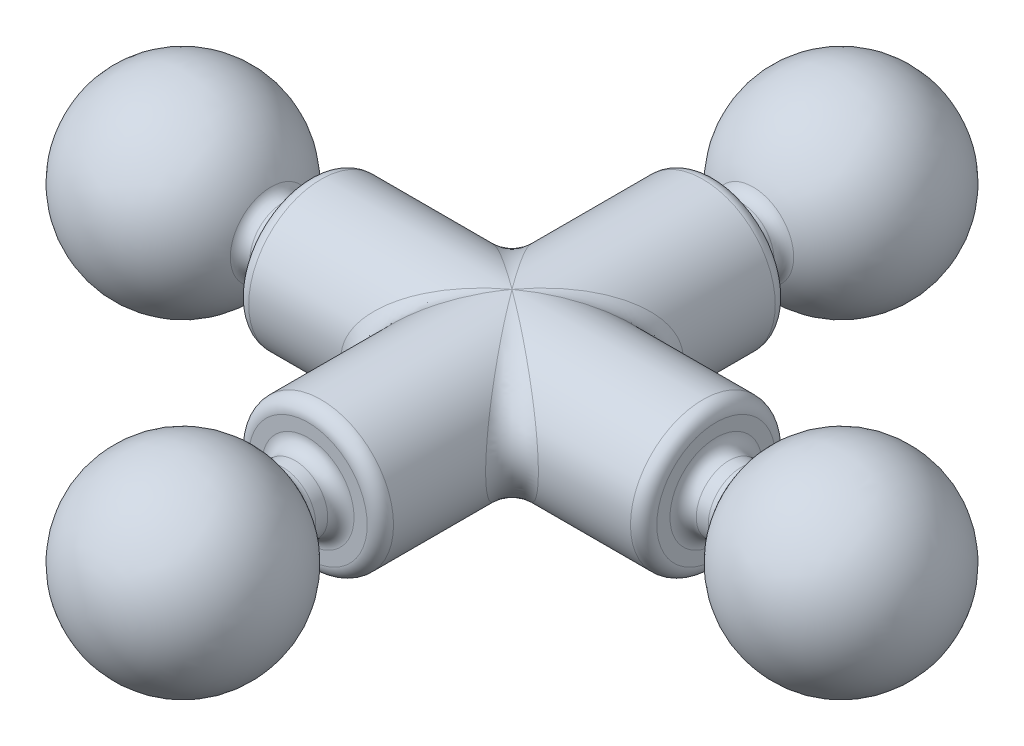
ISO-10303-21;
HEADER;
FILE_DESCRIPTION(('STEP AP214'),'2;1');
FILE_NAME('part.step','',(''),(''),'','','');
FILE_SCHEMA(('AUTOMOTIVE_DESIGN { 1 0 10303 214 1 1 1 1 }'));
ENDSEC;
DATA;
#1=APPLICATION_CONTEXT('core data for automotive mechanical design processes');
#2=APPLICATION_PROTOCOL_DEFINITION('international standard','automotive_design',2000,#1);
#3=PRODUCT_CONTEXT('',#1,'mechanical');
#4=PRODUCT('Part','Part','',(#3));
#5=PRODUCT_RELATED_PRODUCT_CATEGORY('part','',(#4));
#6=PRODUCT_DEFINITION_FORMATION('','',#4);
#7=PRODUCT_DEFINITION_CONTEXT('part definition',#1,'design');
#8=PRODUCT_DEFINITION('design','',#6,#7);
#9=PRODUCT_DEFINITION_SHAPE('','',#8);
#10=(LENGTH_UNIT() NAMED_UNIT(*) SI_UNIT(.MILLI.,.METRE.));
#11=(NAMED_UNIT(*) PLANE_ANGLE_UNIT() SI_UNIT($,.RADIAN.));
#12=(NAMED_UNIT(*) SI_UNIT($,.STERADIAN.) SOLID_ANGLE_UNIT());
#13=UNCERTAINTY_MEASURE_WITH_UNIT(LENGTH_MEASURE(1.E-05),#10,'distance_accuracy_value','');
#14=(GEOMETRIC_REPRESENTATION_CONTEXT(3) GLOBAL_UNCERTAINTY_ASSIGNED_CONTEXT((#13)) GLOBAL_UNIT_ASSIGNED_CONTEXT((#10,
#11,#12)) REPRESENTATION_CONTEXT('',''));
#15=CARTESIAN_POINT('',(0.,0.,0.));
#16=DIRECTION('',(0.,0.,1.));
#17=DIRECTION('',(1.,0.,0.));
#18=AXIS2_PLACEMENT_3D('',#15,#16,#17);
#19=CARTESIAN_POINT('',(-53.1625118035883,0.,0.));
#20=DIRECTION('',(-1.,0.,0.));
#21=DIRECTION('',(0.,0.,1.));
#22=AXIS2_PLACEMENT_3D('',#19,#20,#21);
#23=CYLINDRICAL_SURFACE('',#22,6.985);
#24=CARTESIAN_POINT('',(18.415,0.,0.));
#25=DIRECTION('',(-1.,0.,0.));
#26=DIRECTION('',(0.,0.,1.));
#27=AXIS2_PLACEMENT_3D('',#24,#25,#26);
#28=CIRCLE('',#27,6.985);
#29=CARTESIAN_POINT('',(18.415,0.,6.985));
#30=VERTEX_POINT('',#29);
#31=EDGE_CURVE('E100',#30,#30,#28,.T.);
#32=ORIENTED_EDGE('',*,*,#31,.T.);
#33=EDGE_LOOP('',(#32));
#34=FACE_BOUND('',#33,.T.);
#35=CARTESIAN_POINT('',(0.,0.,0.));
#36=DIRECTION('',(0.591363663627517,0.,-0.806404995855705));
#37=DIRECTION('',(0.806404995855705,0.,0.591363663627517));
#38=AXIS2_PLACEMENT_3D('',#35,#36,#37);
#39=ELLIPSE('',#38,11.8116827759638,6.985);
#40=CARTESIAN_POINT('',(0.,6.985,0.));
#41=VERTEX_POINT('',#40);
#42=CARTESIAN_POINT('',(0.,-6.985,0.));
#43=VERTEX_POINT('',#42);
#44=EDGE_CURVE('E60',#41,#43,#39,.T.);
#45=ORIENTED_EDGE('',*,*,#44,.T.);
#46=CARTESIAN_POINT('',(0.,0.,0.));
#47=DIRECTION('',(-0.591363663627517,0.,-0.806404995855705));
#48=DIRECTION('',(-0.806404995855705,0.,0.591363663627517));
#49=AXIS2_PLACEMENT_3D('',#46,#47,#48);
#50=ELLIPSE('',#49,11.8116827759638,6.985);
#51=EDGE_CURVE('E66',#43,#41,#50,.F.);
#52=ORIENTED_EDGE('',*,*,#51,.T.);
#53=EDGE_LOOP('',(#45,#52));
#54=FACE_BOUND('',#53,.T.);
#55=ADVANCED_FACE('F32',(#34,#54),#23,.T.);
#56=CARTESIAN_POINT('',(31.75,0.,0.));
#57=DIRECTION('',(-1.,0.,0.));
#58=DIRECTION('',(0.,1.,0.));
#59=AXIS2_PLACEMENT_3D('',#56,#57,#58);
#60=SPHERICAL_SURFACE('',#59,9.3472);
#61=CARTESIAN_POINT('',(23.2614064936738,0.,0.));
#62=DIRECTION('',(-1.,0.,0.));
#63=DIRECTION('',(0.,0.,1.));
#64=AXIS2_PLACEMENT_3D('',#61,#62,#63);
#65=CIRCLE('',#64,3.9133014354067);
#66=CARTESIAN_POINT('',(23.2614064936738,0.,3.9133014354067));
#67=VERTEX_POINT('',#66);
#68=EDGE_CURVE('E79',#67,#67,#65,.T.);
#69=ORIENTED_EDGE('',*,*,#68,.F.);
#70=EDGE_LOOP('',(#69));
#71=FACE_BOUND('',#70,.T.);
#72=ADVANCED_FACE('F203',(#71),#60,.T.);
#73=CARTESIAN_POINT('',(22.108064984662,0.,0.));
#74=DIRECTION('',(-1.,0.,0.));
#75=DIRECTION('',(0.,0.,1.));
#76=AXIS2_PLACEMENT_3D('',#73,#74,#75);
#77=TOROIDAL_SURFACE('',#76,4.44500000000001,1.27);
#78=CARTESIAN_POINT('',(22.108064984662,0.,0.));
#79=DIRECTION('',(-1.,0.,0.));
#80=DIRECTION('',(0.,0.,1.));
#81=AXIS2_PLACEMENT_3D('',#78,#79,#80);
#82=CIRCLE('',#81,3.17500000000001);
#83=CARTESIAN_POINT('',(22.108064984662,0.,3.17500000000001));
#84=VERTEX_POINT('',#83);
#85=EDGE_CURVE('E88',#84,#84,#82,.T.);
#86=ORIENTED_EDGE('',*,*,#85,.F.);
#87=EDGE_LOOP('',(#86));
#88=FACE_BOUND('',#87,.T.);
#89=ORIENTED_EDGE('',*,*,#68,.T.);
#90=EDGE_LOOP('',(#89));
#91=FACE_BOUND('',#90,.T.);
#92=ADVANCED_FACE('F208',(#88,#91),#77,.F.);
#93=CARTESIAN_POINT('',(-53.1625118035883,0.,0.));
#94=DIRECTION('',(-1.,0.,0.));
#95=DIRECTION('',(0.,0.,1.));
#96=AXIS2_PLACEMENT_3D('',#93,#94,#95);
#97=CYLINDRICAL_SURFACE('',#96,3.17500000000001);
#98=CARTESIAN_POINT('',(20.955,0.,0.));
#99=DIRECTION('',(-1.,0.,0.));
#100=DIRECTION('',(0.,0.,1.));
#101=AXIS2_PLACEMENT_3D('',#98,#99,#100);
#102=CIRCLE('',#101,3.17500000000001);
#103=CARTESIAN_POINT('',(20.955,0.,3.17500000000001));
#104=VERTEX_POINT('',#103);
#105=EDGE_CURVE('E91',#104,#104,#102,.T.);
#106=ORIENTED_EDGE('',*,*,#105,.F.);
#107=EDGE_LOOP('',(#106));
#108=FACE_BOUND('',#107,.T.);
#109=ORIENTED_EDGE('',*,*,#85,.T.);
#110=EDGE_LOOP('',(#109));
#111=FACE_BOUND('',#110,.T.);
#112=ADVANCED_FACE('F225',(#108,#111),#97,.T.);
#113=CARTESIAN_POINT('',(20.955,0.,0.));
#114=DIRECTION('',(-1.,0.,0.));
#115=DIRECTION('',(0.,0.,1.));
#116=AXIS2_PLACEMENT_3D('',#113,#114,#115);
#117=TOROIDAL_SURFACE('',#116,4.44500000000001,1.27);
#118=CARTESIAN_POINT('',(19.685,0.,0.));
#119=DIRECTION('',(-1.,0.,0.));
#120=DIRECTION('',(0.,0.,1.));
#121=AXIS2_PLACEMENT_3D('',#118,#119,#120);
#122=CIRCLE('',#121,4.44500000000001);
#123=CARTESIAN_POINT('',(19.685,0.,4.44500000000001));
#124=VERTEX_POINT('',#123);
#125=EDGE_CURVE('E94',#124,#124,#122,.T.);
#126=ORIENTED_EDGE('',*,*,#125,.F.);
#127=EDGE_LOOP('',(#126));
#128=FACE_BOUND('',#127,.T.);
#129=ORIENTED_EDGE('',*,*,#105,.T.);
#130=EDGE_LOOP('',(#129));
#131=FACE_BOUND('',#130,.T.);
#132=ADVANCED_FACE('F220',(#128,#131),#117,.F.);
#133=CARTESIAN_POINT('',(19.685,4.44500000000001,0.));
#134=DIRECTION('',(-1.,0.,0.));
#135=DIRECTION('',(0.,0.,1.));
#136=AXIS2_PLACEMENT_3D('',#133,#134,#135);
#137=PLANE('',#136);
#138=CARTESIAN_POINT('',(19.685,0.,0.));
#139=DIRECTION('',(-1.,0.,0.));
#140=DIRECTION('',(0.,0.,1.));
#141=AXIS2_PLACEMENT_3D('',#138,#139,#140);
#142=CIRCLE('',#141,5.71500000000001);
#143=CARTESIAN_POINT('',(19.685,0.,5.71500000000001));
#144=VERTEX_POINT('',#143);
#145=EDGE_CURVE('E97',#144,#144,#142,.T.);
#146=ORIENTED_EDGE('',*,*,#145,.F.);
#147=EDGE_LOOP('',(#146));
#148=FACE_BOUND('',#147,.T.);
#149=ORIENTED_EDGE('',*,*,#125,.T.);
#150=EDGE_LOOP('',(#149));
#151=FACE_BOUND('',#150,.T.);
#152=ADVANCED_FACE('F215',(#148,#151),#137,.F.);
#153=CARTESIAN_POINT('',(18.415,0.,0.));
#154=DIRECTION('',(-1.,0.,0.));
#155=DIRECTION('',(0.,0.,1.));
#156=AXIS2_PLACEMENT_3D('',#153,#154,#155);
#157=TOROIDAL_SURFACE('',#156,5.71500000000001,1.27);
#158=ORIENTED_EDGE('',*,*,#31,.F.);
#159=EDGE_LOOP('',(#158));
#160=FACE_BOUND('',#159,.T.);
#161=ORIENTED_EDGE('',*,*,#145,.T.);
#162=EDGE_LOOP('',(#161));
#163=FACE_BOUND('',#162,.T.);
#164=ADVANCED_FACE('F185',(#160,#163),#157,.T.);
#165=CARTESIAN_POINT('',(0.,0.,31.75));
#166=DIRECTION('',(0.,0.,1.));
#167=DIRECTION('',(0.,1.,0.));
#168=AXIS2_PLACEMENT_3D('',#165,#166,#167);
#169=SPHERICAL_SURFACE('',#168,9.3472);
#170=CARTESIAN_POINT('',(0.,0.,23.2614064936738));
#171=DIRECTION('',(0.,0.,1.));
#172=DIRECTION('',(1.,0.,0.));
#173=AXIS2_PLACEMENT_3D('',#170,#171,#172);
#174=CIRCLE('',#173,3.9133014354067);
#175=CARTESIAN_POINT('',(3.9133014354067,0.,23.2614064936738));
#176=VERTEX_POINT('',#175);
#177=EDGE_CURVE('E154',#176,#176,#174,.T.);
#178=ORIENTED_EDGE('',*,*,#177,.T.);
#179=EDGE_LOOP('',(#178));
#180=FACE_BOUND('',#179,.T.);
#181=ADVANCED_FACE('F214',(#180),#169,.T.);
#182=CARTESIAN_POINT('',(0.,0.,22.1080649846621));
#183=DIRECTION('',(0.,0.,1.));
#184=DIRECTION('',(1.,0.,0.));
#185=AXIS2_PLACEMENT_3D('',#182,#183,#184);
#186=TOROIDAL_SURFACE('',#185,4.445,1.27);
#187=ORIENTED_EDGE('',*,*,#177,.F.);
#188=EDGE_LOOP('',(#187));
#189=FACE_BOUND('',#188,.T.);
#190=CARTESIAN_POINT('',(0.,0.,22.1080649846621));
#191=DIRECTION('',(0.,0.,1.));
#192=DIRECTION('',(1.,0.,0.));
#193=AXIS2_PLACEMENT_3D('',#190,#191,#192);
#194=CIRCLE('',#193,3.175);
#195=CARTESIAN_POINT('',(3.175,0.,22.1080649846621));
#196=VERTEX_POINT('',#195);
#197=EDGE_CURVE('E151',#196,#196,#194,.T.);
#198=ORIENTED_EDGE('',*,*,#197,.T.);
#199=EDGE_LOOP('',(#198));
#200=FACE_BOUND('',#199,.T.);
#201=ADVANCED_FACE('F173',(#189,#200),#186,.F.);
#202=CARTESIAN_POINT('',(0.,0.,53.1625118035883));
#203=DIRECTION('',(0.,0.,1.));
#204=DIRECTION('',(1.,0.,0.));
#205=AXIS2_PLACEMENT_3D('',#202,#203,#204);
#206=CYLINDRICAL_SURFACE('',#205,3.175);
#207=ORIENTED_EDGE('',*,*,#197,.F.);
#208=EDGE_LOOP('',(#207));
#209=FACE_BOUND('',#208,.T.);
#210=CARTESIAN_POINT('',(0.,0.,20.955));
#211=DIRECTION('',(0.,0.,1.));
#212=DIRECTION('',(1.,0.,0.));
#213=AXIS2_PLACEMENT_3D('',#210,#211,#212);
#214=CIRCLE('',#213,3.175);
#215=CARTESIAN_POINT('',(3.175,0.,20.955));
#216=VERTEX_POINT('',#215);
#217=EDGE_CURVE('E148',#216,#216,#214,.T.);
#218=ORIENTED_EDGE('',*,*,#217,.T.);
#219=EDGE_LOOP('',(#218));
#220=FACE_BOUND('',#219,.T.);
#221=ADVANCED_FACE('F273',(#209,#220),#206,.T.);
#222=CARTESIAN_POINT('',(0.,0.,20.955));
#223=DIRECTION('',(0.,0.,1.));
#224=DIRECTION('',(1.,0.,0.));
#225=AXIS2_PLACEMENT_3D('',#222,#223,#224);
#226=TOROIDAL_SURFACE('',#225,4.445,1.27);
#227=ORIENTED_EDGE('',*,*,#217,.F.);
#228=EDGE_LOOP('',(#227));
#229=FACE_BOUND('',#228,.T.);
#230=CARTESIAN_POINT('',(0.,0.,19.685));
#231=DIRECTION('',(0.,0.,1.));
#232=DIRECTION('',(1.,0.,0.));
#233=AXIS2_PLACEMENT_3D('',#230,#231,#232);
#234=CIRCLE('',#233,4.445);
#235=CARTESIAN_POINT('',(4.445,0.,19.685));
#236=VERTEX_POINT('',#235);
#237=EDGE_CURVE('E145',#236,#236,#234,.T.);
#238=ORIENTED_EDGE('',*,*,#237,.T.);
#239=EDGE_LOOP('',(#238));
#240=FACE_BOUND('',#239,.T.);
#241=ADVANCED_FACE('F280',(#229,#240),#226,.F.);
#242=CARTESIAN_POINT('',(0.,4.445,19.685));
#243=DIRECTION('',(0.,0.,-1.));
#244=DIRECTION('',(-1.,0.,0.));
#245=AXIS2_PLACEMENT_3D('',#242,#243,#244);
#246=PLANE('',#245);
#247=ORIENTED_EDGE('',*,*,#237,.F.);
#248=EDGE_LOOP('',(#247));
#249=FACE_BOUND('',#248,.T.);
#250=CARTESIAN_POINT('',(0.,0.,19.685));
#251=DIRECTION('',(0.,0.,1.));
#252=DIRECTION('',(1.,0.,0.));
#253=AXIS2_PLACEMENT_3D('',#250,#251,#252);
#254=CIRCLE('',#253,5.715);
#255=CARTESIAN_POINT('',(5.715,0.,19.685));
#256=VERTEX_POINT('',#255);
#257=EDGE_CURVE('E142',#256,#256,#254,.T.);
#258=ORIENTED_EDGE('',*,*,#257,.T.);
#259=EDGE_LOOP('',(#258));
#260=FACE_BOUND('',#259,.T.);
#261=ADVANCED_FACE('F287',(#249,#260),#246,.F.);
#262=CARTESIAN_POINT('',(0.,0.,18.415));
#263=DIRECTION('',(0.,0.,1.));
#264=DIRECTION('',(1.,0.,0.));
#265=AXIS2_PLACEMENT_3D('',#262,#263,#264);
#266=TOROIDAL_SURFACE('',#265,5.715,1.27);
#267=ORIENTED_EDGE('',*,*,#257,.F.);
#268=EDGE_LOOP('',(#267));
#269=FACE_BOUND('',#268,.T.);
#270=CARTESIAN_POINT('',(0.,0.,18.415));
#271=DIRECTION('',(0.,0.,1.));
#272=DIRECTION('',(1.,0.,0.));
#273=AXIS2_PLACEMENT_3D('',#270,#271,#272);
#274=CIRCLE('',#273,6.985);
#275=CARTESIAN_POINT('',(6.985,0.,18.415));
#276=VERTEX_POINT('',#275);
#277=EDGE_CURVE('E139',#276,#276,#274,.T.);
#278=ORIENTED_EDGE('',*,*,#277,.T.);
#279=EDGE_LOOP('',(#278));
#280=FACE_BOUND('',#279,.T.);
#281=ADVANCED_FACE('F295',(#269,#280),#266,.T.);
#282=CARTESIAN_POINT('',(0.,0.,53.1625118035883));
#283=DIRECTION('',(0.,0.,1.));
#284=DIRECTION('',(1.,0.,0.));
#285=AXIS2_PLACEMENT_3D('',#282,#283,#284);
#286=CYLINDRICAL_SURFACE('',#285,6.985);
#287=ORIENTED_EDGE('',*,*,#277,.F.);
#288=EDGE_LOOP('',(#287));
#289=FACE_BOUND('',#288,.T.);
#290=CARTESIAN_POINT('',(0.,0.,0.));
#291=DIRECTION('',(-0.806404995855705,0.,-0.591363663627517));
#292=DIRECTION('',(-0.591363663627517,0.,0.806404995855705));
#293=AXIS2_PLACEMENT_3D('',#290,#291,#292);
#294=ELLIPSE('',#293,11.8116827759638,6.985);
#295=EDGE_CURVE('E72',#41,#43,#294,.F.);
#296=ORIENTED_EDGE('',*,*,#295,.T.);
#297=CARTESIAN_POINT('',(0.,0.,0.));
#298=DIRECTION('',(0.806404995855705,0.,-0.591363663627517));
#299=DIRECTION('',(0.591363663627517,0.,0.806404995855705));
#300=AXIS2_PLACEMENT_3D('',#297,#298,#299);
#301=ELLIPSE('',#300,11.8116827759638,6.985);
#302=EDGE_CURVE('E56',#43,#41,#301,.F.);
#303=ORIENTED_EDGE('',*,*,#302,.T.);
#304=EDGE_LOOP('',(#296,#303));
#305=FACE_BOUND('',#304,.T.);
#306=ADVANCED_FACE('F71',(#289,#305),#286,.T.);
#307=CARTESIAN_POINT('',(-31.75,0.,0.));
#308=DIRECTION('',(-1.,0.,0.));
#309=DIRECTION('',(0.,1.,0.));
#310=AXIS2_PLACEMENT_3D('',#307,#308,#309);
#311=SPHERICAL_SURFACE('',#310,9.3472);
#312=CARTESIAN_POINT('',(-23.2614064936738,0.,0.));
#313=DIRECTION('',(-1.,0.,0.));
#314=DIRECTION('',(0.,0.,1.));
#315=AXIS2_PLACEMENT_3D('',#312,#313,#314);
#316=CIRCLE('',#315,3.9133014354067);
#317=CARTESIAN_POINT('',(-23.2614064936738,0.,3.9133014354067));
#318=VERTEX_POINT('',#317);
#319=EDGE_CURVE('E118',#318,#318,#316,.T.);
#320=ORIENTED_EDGE('',*,*,#319,.T.);
#321=EDGE_LOOP('',(#320));
#322=FACE_BOUND('',#321,.T.);
#323=ADVANCED_FACE('F34',(#322),#311,.T.);
#324=CARTESIAN_POINT('',(-22.1080649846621,0.,0.));
#325=DIRECTION('',(-1.,0.,0.));
#326=DIRECTION('',(0.,0.,1.));
#327=AXIS2_PLACEMENT_3D('',#324,#325,#326);
#328=TOROIDAL_SURFACE('',#327,4.445,1.27);
#329=ORIENTED_EDGE('',*,*,#319,.F.);
#330=EDGE_LOOP('',(#329));
#331=FACE_BOUND('',#330,.T.);
#332=CARTESIAN_POINT('',(-22.1080649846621,0.,0.));
#333=DIRECTION('',(-1.,0.,0.));
#334=DIRECTION('',(0.,0.,1.));
#335=AXIS2_PLACEMENT_3D('',#332,#333,#334);
#336=CIRCLE('',#335,3.175);
#337=CARTESIAN_POINT('',(-22.1080649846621,0.,3.175));
#338=VERTEX_POINT('',#337);
#339=EDGE_CURVE('E115',#338,#338,#336,.T.);
#340=ORIENTED_EDGE('',*,*,#339,.T.);
#341=EDGE_LOOP('',(#340));
#342=FACE_BOUND('',#341,.T.);
#343=ADVANCED_FACE('F317',(#331,#342),#328,.F.);
#344=CARTESIAN_POINT('',(-53.1625118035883,0.,0.));
#345=DIRECTION('',(-1.,0.,0.));
#346=DIRECTION('',(0.,0.,1.));
#347=AXIS2_PLACEMENT_3D('',#344,#345,#346);
#348=CYLINDRICAL_SURFACE('',#347,3.175);
#349=ORIENTED_EDGE('',*,*,#339,.F.);
#350=EDGE_LOOP('',(#349));
#351=FACE_BOUND('',#350,.T.);
#352=CARTESIAN_POINT('',(-20.955,0.,0.));
#353=DIRECTION('',(-1.,0.,0.));
#354=DIRECTION('',(0.,0.,1.));
#355=AXIS2_PLACEMENT_3D('',#352,#353,#354);
#356=CIRCLE('',#355,3.175);
#357=CARTESIAN_POINT('',(-20.955,0.,3.175));
#358=VERTEX_POINT('',#357);
#359=EDGE_CURVE('E112',#358,#358,#356,.T.);
#360=ORIENTED_EDGE('',*,*,#359,.T.);
#361=EDGE_LOOP('',(#360));
#362=FACE_BOUND('',#361,.T.);
#363=ADVANCED_FACE('F323',(#351,#362),#348,.T.);
#364=CARTESIAN_POINT('',(-20.955,0.,0.));
#365=DIRECTION('',(-1.,0.,0.));
#366=DIRECTION('',(0.,0.,1.));
#367=AXIS2_PLACEMENT_3D('',#364,#365,#366);
#368=TOROIDAL_SURFACE('',#367,4.445,1.27);
#369=ORIENTED_EDGE('',*,*,#359,.F.);
#370=EDGE_LOOP('',(#369));
#371=FACE_BOUND('',#370,.T.);
#372=CARTESIAN_POINT('',(-19.685,0.,0.));
#373=DIRECTION('',(-1.,0.,0.));
#374=DIRECTION('',(0.,0.,1.));
#375=AXIS2_PLACEMENT_3D('',#372,#373,#374);
#376=CIRCLE('',#375,4.445);
#377=CARTESIAN_POINT('',(-19.685,0.,4.445));
#378=VERTEX_POINT('',#377);
#379=EDGE_CURVE('E109',#378,#378,#376,.T.);
#380=ORIENTED_EDGE('',*,*,#379,.T.);
#381=EDGE_LOOP('',(#380));
#382=FACE_BOUND('',#381,.T.);
#383=ADVANCED_FACE('F331',(#371,#382),#368,.F.);
#384=CARTESIAN_POINT('',(-19.685,4.445,0.));
#385=DIRECTION('',(1.,0.,0.));
#386=DIRECTION('',(0.,0.,-1.));
#387=AXIS2_PLACEMENT_3D('',#384,#385,#386);
#388=PLANE('',#387);
#389=ORIENTED_EDGE('',*,*,#379,.F.);
#390=EDGE_LOOP('',(#389));
#391=FACE_BOUND('',#390,.T.);
#392=CARTESIAN_POINT('',(-19.685,0.,0.));
#393=DIRECTION('',(-1.,0.,0.));
#394=DIRECTION('',(0.,0.,1.));
#395=AXIS2_PLACEMENT_3D('',#392,#393,#394);
#396=CIRCLE('',#395,5.715);
#397=CARTESIAN_POINT('',(-19.685,0.,5.715));
#398=VERTEX_POINT('',#397);
#399=EDGE_CURVE('E106',#398,#398,#396,.T.);
#400=ORIENTED_EDGE('',*,*,#399,.T.);
#401=EDGE_LOOP('',(#400));
#402=FACE_BOUND('',#401,.T.);
#403=ADVANCED_FACE('F339',(#391,#402),#388,.F.);
#404=CARTESIAN_POINT('',(-18.415,0.,0.));
#405=DIRECTION('',(-1.,0.,0.));
#406=DIRECTION('',(0.,0.,1.));
#407=AXIS2_PLACEMENT_3D('',#404,#405,#406);
#408=TOROIDAL_SURFACE('',#407,5.715,1.27);
#409=ORIENTED_EDGE('',*,*,#399,.F.);
#410=EDGE_LOOP('',(#409));
#411=FACE_BOUND('',#410,.T.);
#412=CARTESIAN_POINT('',(-18.415,0.,0.));
#413=DIRECTION('',(-1.,0.,0.));
#414=DIRECTION('',(0.,0.,1.));
#415=AXIS2_PLACEMENT_3D('',#412,#413,#414);
#416=CIRCLE('',#415,6.985);
#417=CARTESIAN_POINT('',(-18.415,0.,6.985));
#418=VERTEX_POINT('',#417);
#419=EDGE_CURVE('E103',#418,#418,#416,.T.);
#420=ORIENTED_EDGE('',*,*,#419,.T.);
#421=EDGE_LOOP('',(#420));
#422=FACE_BOUND('',#421,.T.);
#423=ADVANCED_FACE('F182',(#411,#422),#408,.T.);
#424=ORIENTED_EDGE('',*,*,#419,.F.);
#425=EDGE_LOOP('',(#424));
#426=FACE_BOUND('',#425,.T.);
#427=CARTESIAN_POINT('',(0.,0.,0.));
#428=DIRECTION('',(0.591363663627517,0.,-0.806404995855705));
#429=DIRECTION('',(0.806404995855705,0.,0.591363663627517));
#430=AXIS2_PLACEMENT_3D('',#427,#428,#429);
#431=ELLIPSE('',#430,11.8116827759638,6.985);
#432=EDGE_CURVE('E40',#41,#43,#431,.F.);
#433=ORIENTED_EDGE('',*,*,#432,.T.);
#434=CARTESIAN_POINT('',(0.,0.,0.));
#435=DIRECTION('',(-0.591363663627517,0.,-0.806404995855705));
#436=DIRECTION('',(-0.806404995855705,0.,0.591363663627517));
#437=AXIS2_PLACEMENT_3D('',#434,#435,#436);
#438=ELLIPSE('',#437,11.8116827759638,6.985);
#439=EDGE_CURVE('E11',#43,#41,#438,.T.);
#440=ORIENTED_EDGE('',*,*,#439,.T.);
#441=EDGE_LOOP('',(#433,#440));
#442=FACE_BOUND('',#441,.T.);
#443=ADVANCED_FACE('F69',(#426,#442),#23,.T.);
#444=CARTESIAN_POINT('',(0.,0.,-18.415));
#445=DIRECTION('',(0.,0.,1.));
#446=DIRECTION('',(1.,0.,0.));
#447=AXIS2_PLACEMENT_3D('',#444,#445,#446);
#448=CIRCLE('',#447,6.985);
#449=CARTESIAN_POINT('',(6.985,0.,-18.415));
#450=VERTEX_POINT('',#449);
#451=EDGE_CURVE('E136',#450,#450,#448,.T.);
#452=ORIENTED_EDGE('',*,*,#451,.T.);
#453=EDGE_LOOP('',(#452));
#454=FACE_BOUND('',#453,.T.);
#455=CARTESIAN_POINT('',(0.,0.,0.));
#456=DIRECTION('',(0.806404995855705,0.,-0.591363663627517));
#457=DIRECTION('',(0.591363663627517,0.,0.806404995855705));
#458=AXIS2_PLACEMENT_3D('',#455,#456,#457);
#459=ELLIPSE('',#458,11.8116827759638,6.985);
#460=EDGE_CURVE('E53',#43,#41,#459,.T.);
#461=ORIENTED_EDGE('',*,*,#460,.T.);
#462=CARTESIAN_POINT('',(0.,0.,0.));
#463=DIRECTION('',(-0.806404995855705,0.,-0.591363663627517));
#464=DIRECTION('',(-0.591363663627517,0.,0.806404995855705));
#465=AXIS2_PLACEMENT_3D('',#462,#463,#464);
#466=ELLIPSE('',#465,11.8116827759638,6.985);
#467=EDGE_CURVE('E67',#41,#43,#466,.T.);
#468=ORIENTED_EDGE('',*,*,#467,.T.);
#469=EDGE_LOOP('',(#461,#468));
#470=FACE_BOUND('',#469,.T.);
#471=ADVANCED_FACE('F78',(#454,#470),#286,.T.);
#472=CARTESIAN_POINT('',(0.,0.,-31.75));
#473=DIRECTION('',(0.,0.,1.));
#474=DIRECTION('',(0.,1.,0.));
#475=AXIS2_PLACEMENT_3D('',#472,#473,#474);
#476=SPHERICAL_SURFACE('',#475,9.3472);
#477=CARTESIAN_POINT('',(0.,0.,-23.2614064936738));
#478=DIRECTION('',(0.,0.,1.));
#479=DIRECTION('',(1.,0.,0.));
#480=AXIS2_PLACEMENT_3D('',#477,#478,#479);
#481=CIRCLE('',#480,3.9133014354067);
#482=CARTESIAN_POINT('',(3.9133014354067,0.,-23.2614064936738));
#483=VERTEX_POINT('',#482);
#484=EDGE_CURVE('E121',#483,#483,#481,.T.);
#485=ORIENTED_EDGE('',*,*,#484,.F.);
#486=EDGE_LOOP('',(#485));
#487=FACE_BOUND('',#486,.T.);
#488=ADVANCED_FACE('F361',(#487),#476,.T.);
#489=CARTESIAN_POINT('',(0.,0.,-22.108064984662));
#490=DIRECTION('',(0.,0.,1.));
#491=DIRECTION('',(1.,0.,0.));
#492=AXIS2_PLACEMENT_3D('',#489,#490,#491);
#493=TOROIDAL_SURFACE('',#492,4.44500000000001,1.27);
#494=CARTESIAN_POINT('',(0.,0.,-22.108064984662));
#495=DIRECTION('',(0.,0.,1.));
#496=DIRECTION('',(1.,0.,0.));
#497=AXIS2_PLACEMENT_3D('',#494,#495,#496);
#498=CIRCLE('',#497,3.17500000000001);
#499=CARTESIAN_POINT('',(3.17500000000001,0.,-22.108064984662));
#500=VERTEX_POINT('',#499);
#501=EDGE_CURVE('E124',#500,#500,#498,.T.);
#502=ORIENTED_EDGE('',*,*,#501,.F.);
#503=EDGE_LOOP('',(#502));
#504=FACE_BOUND('',#503,.T.);
#505=ORIENTED_EDGE('',*,*,#484,.T.);
#506=EDGE_LOOP('',(#505));
#507=FACE_BOUND('',#506,.T.);
#508=ADVANCED_FACE('F368',(#504,#507),#493,.F.);
#509=CARTESIAN_POINT('',(0.,0.,53.1625118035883));
#510=DIRECTION('',(0.,0.,1.));
#511=DIRECTION('',(1.,0.,0.));
#512=AXIS2_PLACEMENT_3D('',#509,#510,#511);
#513=CYLINDRICAL_SURFACE('',#512,3.17500000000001);
#514=CARTESIAN_POINT('',(0.,0.,-20.955));
#515=DIRECTION('',(0.,0.,1.));
#516=DIRECTION('',(1.,0.,0.));
#517=AXIS2_PLACEMENT_3D('',#514,#515,#516);
#518=CIRCLE('',#517,3.17500000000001);
#519=CARTESIAN_POINT('',(3.17500000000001,0.,-20.955));
#520=VERTEX_POINT('',#519);
#521=EDGE_CURVE('E127',#520,#520,#518,.T.);
#522=ORIENTED_EDGE('',*,*,#521,.F.);
#523=EDGE_LOOP('',(#522));
#524=FACE_BOUND('',#523,.T.);
#525=ORIENTED_EDGE('',*,*,#501,.T.);
#526=EDGE_LOOP('',(#525));
#527=FACE_BOUND('',#526,.T.);
#528=ADVANCED_FACE('F376',(#524,#527),#513,.T.);
#529=CARTESIAN_POINT('',(0.,0.,-20.955));
#530=DIRECTION('',(0.,0.,1.));
#531=DIRECTION('',(1.,0.,0.));
#532=AXIS2_PLACEMENT_3D('',#529,#530,#531);
#533=TOROIDAL_SURFACE('',#532,4.44500000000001,1.27);
#534=CARTESIAN_POINT('',(0.,0.,-19.685));
#535=DIRECTION('',(0.,0.,1.));
#536=DIRECTION('',(1.,0.,0.));
#537=AXIS2_PLACEMENT_3D('',#534,#535,#536);
#538=CIRCLE('',#537,4.44500000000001);
#539=CARTESIAN_POINT('',(4.44500000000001,0.,-19.685));
#540=VERTEX_POINT('',#539);
#541=EDGE_CURVE('E130',#540,#540,#538,.T.);
#542=ORIENTED_EDGE('',*,*,#541,.F.);
#543=EDGE_LOOP('',(#542));
#544=FACE_BOUND('',#543,.T.);
#545=ORIENTED_EDGE('',*,*,#521,.T.);
#546=EDGE_LOOP('',(#545));
#547=FACE_BOUND('',#546,.T.);
#548=ADVANCED_FACE('F384',(#544,#547),#533,.F.);
#549=CARTESIAN_POINT('',(0.,4.44500000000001,-19.685));
#550=DIRECTION('',(0.,0.,1.));
#551=DIRECTION('',(1.,0.,0.));
#552=AXIS2_PLACEMENT_3D('',#549,#550,#551);
#553=PLANE('',#552);
#554=CARTESIAN_POINT('',(0.,0.,-19.685));
#555=DIRECTION('',(0.,0.,1.));
#556=DIRECTION('',(1.,0.,0.));
#557=AXIS2_PLACEMENT_3D('',#554,#555,#556);
#558=CIRCLE('',#557,5.71500000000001);
#559=CARTESIAN_POINT('',(5.71500000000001,0.,-19.685));
#560=VERTEX_POINT('',#559);
#561=EDGE_CURVE('E133',#560,#560,#558,.T.);
#562=ORIENTED_EDGE('',*,*,#561,.F.);
#563=EDGE_LOOP('',(#562));
#564=FACE_BOUND('',#563,.T.);
#565=ORIENTED_EDGE('',*,*,#541,.T.);
#566=EDGE_LOOP('',(#565));
#567=FACE_BOUND('',#566,.T.);
#568=ADVANCED_FACE('F392',(#564,#567),#553,.F.);
#569=CARTESIAN_POINT('',(0.,0.,-18.415));
#570=DIRECTION('',(0.,0.,1.));
#571=DIRECTION('',(1.,0.,0.));
#572=AXIS2_PLACEMENT_3D('',#569,#570,#571);
#573=TOROIDAL_SURFACE('',#572,5.71500000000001,1.27);
#574=ORIENTED_EDGE('',*,*,#451,.F.);
#575=EDGE_LOOP('',(#574));
#576=FACE_BOUND('',#575,.T.);
#577=ORIENTED_EDGE('',*,*,#561,.T.);
#578=EDGE_LOOP('',(#577));
#579=FACE_BOUND('',#578,.T.);
#580=ADVANCED_FACE('F169',(#576,#579),#573,.T.);
#581=CARTESIAN_POINT('',(0.,-6.985,0.));
#582=CARTESIAN_POINT('',(0.,-6.985,0.));
#583=CARTESIAN_POINT('',(0.,-6.985,0.));
#584=CARTESIAN_POINT('',(0.207518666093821,-6.98499123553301,-0.152180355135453));
#585=CARTESIAN_POINT('',(0.179849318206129,-6.9850170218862,-0.179849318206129));
#586=CARTESIAN_POINT('',(0.152180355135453,-6.98499123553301,-0.207518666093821));
#587=CARTESIAN_POINT('',(0.415007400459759,-6.98002686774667,-0.304338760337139));
#588=CARTESIAN_POINT('',(0.359800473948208,-6.97821211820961,-0.359800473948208));
#589=CARTESIAN_POINT('',(0.304338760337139,-6.98002686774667,-0.415007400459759));
#590=CARTESIAN_POINT('',(0.829556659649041,-6.96012788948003,-0.608341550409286));
#591=CARTESIAN_POINT('',(0.718722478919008,-6.95108211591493,-0.718722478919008));
#592=CARTESIAN_POINT('',(0.608341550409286,-6.96012788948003,-0.829556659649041));
#593=CARTESIAN_POINT('',(1.0366171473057,-6.94519244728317,-0.760185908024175));
#594=CARTESIAN_POINT('',(0.897947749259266,-6.93071724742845,-0.897947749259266));
#595=CARTESIAN_POINT('',(0.760185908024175,-6.94519244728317,-1.0366171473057));
#596=CARTESIAN_POINT('',(1.65291142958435,-6.88569361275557,-1.21213504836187));
#597=CARTESIAN_POINT('',(1.4306834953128,-6.84963168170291,-1.4306834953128));
#598=CARTESIAN_POINT('',(1.21213504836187,-6.88569361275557,-1.65291142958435));
#599=CARTESIAN_POINT('',(2.06092742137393,-6.82643806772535,-1.51134677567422));
#600=CARTESIAN_POINT('',(1.78243106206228,-6.76865979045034,-1.78243106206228));
#601=CARTESIAN_POINT('',(1.51134677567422,-6.82643806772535,-2.06092742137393));
#602=CARTESIAN_POINT('',(2.8627936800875,-6.66887827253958,-2.09938203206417));
#603=CARTESIAN_POINT('',(2.46596074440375,-6.55587890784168,-2.46596074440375));
#604=CARTESIAN_POINT('',(2.09938203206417,-6.66887827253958,-2.8627936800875));
#605=CARTESIAN_POINT('',(3.25676676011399,-6.57124565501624,-2.3882956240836));
#606=CARTESIAN_POINT('',(2.79975697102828,-6.4237635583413,-2.79975697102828));
#607=CARTESIAN_POINT('',(2.3882956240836,-6.57124565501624,-3.25676676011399));
#608=CARTESIAN_POINT('',(4.02378726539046,-6.33825696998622,-2.950777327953));
#609=CARTESIAN_POINT('',(3.4388907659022,-6.11331309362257,-3.4388907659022));
#610=CARTESIAN_POINT('',(2.950777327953,-6.33825696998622,-4.02378726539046));
#611=CARTESIAN_POINT('',(4.39711109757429,-6.20388944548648,-3.22454813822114));
#612=CARTESIAN_POINT('',(3.74617683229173,-5.93452750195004,-3.74617683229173));
#613=CARTESIAN_POINT('',(3.22454813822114,-6.20388944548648,-4.39711109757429));
#614=CARTESIAN_POINT('',(5.11625854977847,-5.89940962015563,-3.75192293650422));
#615=CARTESIAN_POINT('',(4.3242791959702,-5.53749996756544,-4.3242791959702));
#616=CARTESIAN_POINT('',(3.75192293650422,-5.89940962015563,-5.11625854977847));
#617=CARTESIAN_POINT('',(5.46257926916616,-5.7305712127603,-4.00589146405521));
#618=CARTESIAN_POINT('',(4.59692468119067,-5.31869043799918,-4.59692468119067));
#619=CARTESIAN_POINT('',(4.00589146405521,-5.7305712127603,-5.46257926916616));
#620=CARTESIAN_POINT('',(6.12156493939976,-5.35975565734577,-4.48914762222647));
#621=CARTESIAN_POINT('',(5.09881415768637,-4.85084033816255,-5.09881415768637));
#622=CARTESIAN_POINT('',(4.48914762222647,-5.35975565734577,-6.12156493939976));
#623=CARTESIAN_POINT('',(6.43500867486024,-5.15928128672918,-4.71900636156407));
#624=CARTESIAN_POINT('',(5.32969254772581,-4.60117676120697,-5.32969254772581));
#625=CARTESIAN_POINT('',(4.71900636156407,-5.15928128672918,-6.43500867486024));
#626=CARTESIAN_POINT('',(7.02258705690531,-4.72837889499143,-5.14989717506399));
#627=CARTESIAN_POINT('',(5.74296833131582,-4.08348087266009,-5.74296833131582));
#628=CARTESIAN_POINT('',(5.14989717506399,-4.72837889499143,-7.02258705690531));
#629=CARTESIAN_POINT('',(7.29782747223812,-4.49959081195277,-5.35174014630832));
#630=CARTESIAN_POINT('',(5.92671748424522,-3.81488376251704,-5.92671748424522));
#631=CARTESIAN_POINT('',(5.35174014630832,-4.49959081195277,-7.29782747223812));
#632=CARTESIAN_POINT('',(7.80391826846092,-4.01592615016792,-5.722873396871));
#633=CARTESIAN_POINT('',(6.24373773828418,-3.27348203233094,-6.24373773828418));
#634=CARTESIAN_POINT('',(5.722873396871,-4.01592615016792,-7.80391826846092));
#635=CARTESIAN_POINT('',(8.03620781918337,-3.7626844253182,-5.89321906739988));
#636=CARTESIAN_POINT('',(6.37799699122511,-3.00034770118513,-6.37799699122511));
#637=CARTESIAN_POINT('',(5.89321906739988,-3.7626844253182,-8.03620781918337));
#638=CARTESIAN_POINT('',(8.45218311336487,-3.2342480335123,-6.19826761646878));
#639=CARTESIAN_POINT('',(6.59861399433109,-2.46464840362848,-6.59861399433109));
#640=CARTESIAN_POINT('',(6.19826761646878,-3.2342480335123,-8.45218311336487));
#641=CARTESIAN_POINT('',(8.63756232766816,-2.96051683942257,-6.33421237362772));
#642=CARTESIAN_POINT('',(6.68556307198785,-2.20220161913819,-6.68556307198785));
#643=CARTESIAN_POINT('',(6.33421237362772,-2.96051683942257,-8.63756232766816));
#644=CARTESIAN_POINT('',(8.87803834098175,-2.53481154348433,-6.51056145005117));
#645=CARTESIAN_POINT('',(6.78617942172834,-1.82528725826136,-6.78617942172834));
#646=CARTESIAN_POINT('',(6.51056145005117,-2.53481154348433,-8.87803834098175));
#647=CARTESIAN_POINT('',(8.95080863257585,-2.39340192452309,-6.56392633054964));
#648=CARTESIAN_POINT('',(6.81456087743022,-1.70372223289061,-6.81456087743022));
#649=CARTESIAN_POINT('',(6.56392633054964,-2.39340192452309,-8.95080863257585));
#650=CARTESIAN_POINT('',(9.08465550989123,-2.10477969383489,-6.66208070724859));
#651=CARTESIAN_POINT('',(6.8635299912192,-1.46462364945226,-6.8635299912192));
#652=CARTESIAN_POINT('',(6.66208070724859,-2.10477969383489,-9.08465550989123));
#653=CARTESIAN_POINT('',(9.14573774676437,-1.95756992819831,-6.70687434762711));
#654=CARTESIAN_POINT('',(6.88398677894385,-1.34733100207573,-6.88398677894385));
#655=CARTESIAN_POINT('',(6.70687434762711,-1.95756992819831,-9.14573774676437));
#656=CARTESIAN_POINT('',(9.25353840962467,-1.66254066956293,-6.78592816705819));
#657=CARTESIAN_POINT('',(6.91772944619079,-1.12088517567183,-6.91772944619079));
#658=CARTESIAN_POINT('',(6.78592816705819,-1.66254066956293,-9.25353840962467));
#659=CARTESIAN_POINT('',(9.30062682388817,-1.51486676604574,-6.82045967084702));
#660=CARTESIAN_POINT('',(6.93111542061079,-1.01183008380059,-6.93111542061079));
#661=CARTESIAN_POINT('',(6.82045967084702,-1.51486676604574,-9.30062682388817));
#662=CARTESIAN_POINT('',(9.38190408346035,-1.21580690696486,-6.88006299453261));
#663=CARTESIAN_POINT('',(6.95283897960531,-0.798095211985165,-6.95283897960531));
#664=CARTESIAN_POINT('',(6.88006299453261,-1.21580690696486,-9.38190408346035));
#665=CARTESIAN_POINT('',(9.41609917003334,-1.06442278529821,-6.90513939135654));
#666=CARTESIAN_POINT('',(6.96111238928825,-0.693701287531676,-6.96111238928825));
#667=CARTESIAN_POINT('',(6.90513939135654,-1.06442278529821,-9.41609917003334));
#668=CARTESIAN_POINT('',(9.47048429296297,-0.761485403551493,-6.94502181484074));
#669=CARTESIAN_POINT('',(6.97367591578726,-0.489977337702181,-6.97367591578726));
#670=CARTESIAN_POINT('',(6.94502181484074,-0.761485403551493,-9.47048429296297));
#671=CARTESIAN_POINT('',(9.49089085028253,-0.609974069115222,-6.95998662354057));
#672=CARTESIAN_POINT('',(6.97799108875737,-0.390868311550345,-6.97799108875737));
#673=CARTESIAN_POINT('',(6.95998662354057,-0.609974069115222,-9.49089085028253));
#674=CARTESIAN_POINT('',(9.51814858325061,-0.30564180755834,-6.97997562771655));
#675=CARTESIAN_POINT('',(6.98366131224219,-0.194365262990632,-6.98366131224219));
#676=CARTESIAN_POINT('',(6.97997562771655,-0.30564180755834,-9.51814858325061));
#677=CARTESIAN_POINT('',(9.525,-0.15282090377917,-6.985));
#678=CARTESIAN_POINT('',(6.985,-0.097252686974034,-6.985));
#679=CARTESIAN_POINT('',(6.985,-0.15282090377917,-9.525));
#680=CARTESIAN_POINT('',(9.525,0.152820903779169,-6.985));
#681=CARTESIAN_POINT('',(6.985,0.0972526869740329,-6.985));
#682=CARTESIAN_POINT('',(6.985,0.152820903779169,-9.525));
#683=CARTESIAN_POINT('',(9.51814858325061,0.305641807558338,-6.97997562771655));
#684=CARTESIAN_POINT('',(6.98366131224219,0.194365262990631,-6.98366131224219));
#685=CARTESIAN_POINT('',(6.97997562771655,0.305641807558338,-9.51814858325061));
#686=CARTESIAN_POINT('',(9.49089085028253,0.60997406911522,-6.95998662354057));
#687=CARTESIAN_POINT('',(6.97799108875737,0.390868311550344,-6.97799108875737));
#688=CARTESIAN_POINT('',(6.95998662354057,0.60997406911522,-9.49089085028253));
#689=CARTESIAN_POINT('',(9.47048429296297,0.761485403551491,-6.94502181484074));
#690=CARTESIAN_POINT('',(6.97367591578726,0.48997733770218,-6.97367591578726));
#691=CARTESIAN_POINT('',(6.94502181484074,0.761485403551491,-9.47048429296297));
#692=CARTESIAN_POINT('',(9.41609917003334,1.06442278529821,-6.90513939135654));
#693=CARTESIAN_POINT('',(6.96111238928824,0.693701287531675,-6.96111238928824));
#694=CARTESIAN_POINT('',(6.90513939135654,1.06442278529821,-9.41609917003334));
#695=CARTESIAN_POINT('',(9.38190408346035,1.21580690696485,-6.88006299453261));
#696=CARTESIAN_POINT('',(6.95283897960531,0.798095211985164,-6.95283897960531));
#697=CARTESIAN_POINT('',(6.88006299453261,1.21580690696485,-9.38190408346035));
#698=CARTESIAN_POINT('',(9.30062682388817,1.51486676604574,-6.82045967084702));
#699=CARTESIAN_POINT('',(6.93111542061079,1.01183008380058,-6.93111542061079));
#700=CARTESIAN_POINT('',(6.82045967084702,1.51486676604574,-9.30062682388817));
#701=CARTESIAN_POINT('',(9.25353840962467,1.66254066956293,-6.78592816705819));
#702=CARTESIAN_POINT('',(6.91772944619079,1.12088517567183,-6.91772944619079));
#703=CARTESIAN_POINT('',(6.78592816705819,1.66254066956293,-9.25353840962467));
#704=CARTESIAN_POINT('',(9.14573774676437,1.9575699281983,-6.70687434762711));
#705=CARTESIAN_POINT('',(6.88398677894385,1.34733100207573,-6.88398677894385));
#706=CARTESIAN_POINT('',(6.70687434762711,1.9575699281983,-9.14573774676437));
#707=CARTESIAN_POINT('',(9.08465550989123,2.10477969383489,-6.66208070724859));
#708=CARTESIAN_POINT('',(6.8635299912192,1.46462364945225,-6.8635299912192));
#709=CARTESIAN_POINT('',(6.66208070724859,2.10477969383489,-9.08465550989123));
#710=CARTESIAN_POINT('',(8.95080863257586,2.39340192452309,-6.56392633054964));
#711=CARTESIAN_POINT('',(6.81456087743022,1.70372223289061,-6.81456087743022));
#712=CARTESIAN_POINT('',(6.56392633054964,2.39340192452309,-8.95080863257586));
#713=CARTESIAN_POINT('',(8.87803834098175,2.53481154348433,-6.51056145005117));
#714=CARTESIAN_POINT('',(6.78617942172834,1.82528725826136,-6.78617942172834));
#715=CARTESIAN_POINT('',(6.51056145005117,2.53481154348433,-8.87803834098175));
#716=CARTESIAN_POINT('',(8.63756232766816,2.96051683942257,-6.33421237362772));
#717=CARTESIAN_POINT('',(6.68556307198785,2.20220161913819,-6.68556307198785));
#718=CARTESIAN_POINT('',(6.33421237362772,2.96051683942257,-8.63756232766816));
#719=CARTESIAN_POINT('',(8.45218311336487,3.2342480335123,-6.19826761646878));
#720=CARTESIAN_POINT('',(6.59861399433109,2.46464840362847,-6.59861399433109));
#721=CARTESIAN_POINT('',(6.19826761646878,3.2342480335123,-8.45218311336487));
#722=CARTESIAN_POINT('',(8.03620781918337,3.7626844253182,-5.89321906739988));
#723=CARTESIAN_POINT('',(6.37799699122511,3.00034770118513,-6.37799699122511));
#724=CARTESIAN_POINT('',(5.89321906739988,3.7626844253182,-8.03620781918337));
#725=CARTESIAN_POINT('',(7.80391826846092,4.01592615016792,-5.722873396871));
#726=CARTESIAN_POINT('',(6.24373773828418,3.27348203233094,-6.24373773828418));
#727=CARTESIAN_POINT('',(5.722873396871,4.01592615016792,-7.80391826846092));
#728=CARTESIAN_POINT('',(7.29782747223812,4.49959081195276,-5.35174014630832));
#729=CARTESIAN_POINT('',(5.92671748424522,3.81488376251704,-5.92671748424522));
#730=CARTESIAN_POINT('',(5.35174014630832,4.49959081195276,-7.29782747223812));
#731=CARTESIAN_POINT('',(7.02258705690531,4.72837889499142,-5.14989717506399));
#732=CARTESIAN_POINT('',(5.74296833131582,4.08348087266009,-5.74296833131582));
#733=CARTESIAN_POINT('',(5.14989717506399,4.72837889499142,-7.02258705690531));
#734=CARTESIAN_POINT('',(6.43500867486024,5.15928128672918,-4.71900636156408));
#735=CARTESIAN_POINT('',(5.32969254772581,4.60117676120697,-5.32969254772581));
#736=CARTESIAN_POINT('',(4.71900636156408,5.15928128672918,-6.43500867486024));
#737=CARTESIAN_POINT('',(6.12156493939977,5.35975565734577,-4.48914762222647));
#738=CARTESIAN_POINT('',(5.09881415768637,4.85084033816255,-5.09881415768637));
#739=CARTESIAN_POINT('',(4.48914762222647,5.35975565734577,-6.12156493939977));
#740=CARTESIAN_POINT('',(5.46257926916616,5.7305712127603,-4.00589146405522));
#741=CARTESIAN_POINT('',(4.59692468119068,5.31869043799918,-4.59692468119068));
#742=CARTESIAN_POINT('',(4.00589146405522,5.7305712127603,-5.46257926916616));
#743=CARTESIAN_POINT('',(5.11625854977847,5.89940962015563,-3.75192293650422));
#744=CARTESIAN_POINT('',(4.32427919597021,5.53749996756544,-4.32427919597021));
#745=CARTESIAN_POINT('',(3.75192293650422,5.89940962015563,-5.11625854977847));
#746=CARTESIAN_POINT('',(4.39711109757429,6.20388944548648,-3.22454813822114));
#747=CARTESIAN_POINT('',(3.74617683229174,5.93452750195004,-3.74617683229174));
#748=CARTESIAN_POINT('',(3.22454813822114,6.20388944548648,-4.39711109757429));
#749=CARTESIAN_POINT('',(4.02378726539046,6.33825696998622,-2.950777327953));
#750=CARTESIAN_POINT('',(3.4388907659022,6.11331309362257,-3.4388907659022));
#751=CARTESIAN_POINT('',(2.950777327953,6.33825696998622,-4.02378726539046));
#752=CARTESIAN_POINT('',(3.25676676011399,6.57124565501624,-2.3882956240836));
#753=CARTESIAN_POINT('',(2.79975697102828,6.4237635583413,-2.79975697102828));
#754=CARTESIAN_POINT('',(2.3882956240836,6.57124565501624,-3.25676676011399));
#755=CARTESIAN_POINT('',(2.8627936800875,6.66887827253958,-2.09938203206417));
#756=CARTESIAN_POINT('',(2.46596074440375,6.55587890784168,-2.46596074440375));
#757=CARTESIAN_POINT('',(2.09938203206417,6.66887827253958,-2.8627936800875));
#758=CARTESIAN_POINT('',(2.06092742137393,6.82643806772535,-1.51134677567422));
#759=CARTESIAN_POINT('',(1.78243106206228,6.76865979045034,-1.78243106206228));
#760=CARTESIAN_POINT('',(1.51134677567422,6.82643806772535,-2.06092742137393));
#761=CARTESIAN_POINT('',(1.65291142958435,6.88569361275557,-1.21213504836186));
#762=CARTESIAN_POINT('',(1.4306834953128,6.84963168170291,-1.4306834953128));
#763=CARTESIAN_POINT('',(1.21213504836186,6.88569361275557,-1.65291142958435));
#764=CARTESIAN_POINT('',(1.0366171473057,6.94519244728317,-0.760185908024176));
#765=CARTESIAN_POINT('',(0.897947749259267,6.93071724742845,-0.897947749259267));
#766=CARTESIAN_POINT('',(0.760185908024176,6.94519244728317,-1.0366171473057));
#767=CARTESIAN_POINT('',(0.829556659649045,6.96012788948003,-0.608341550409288));
#768=CARTESIAN_POINT('',(0.71872247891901,6.95108211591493,-0.71872247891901));
#769=CARTESIAN_POINT('',(0.608341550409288,6.96012788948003,-0.829556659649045));
#770=CARTESIAN_POINT('',(0.415007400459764,6.98002686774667,-0.304338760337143));
#771=CARTESIAN_POINT('',(0.359800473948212,6.97821211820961,-0.359800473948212));
#772=CARTESIAN_POINT('',(0.304338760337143,6.98002686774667,-0.415007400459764));
#773=CARTESIAN_POINT('',(0.207518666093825,6.98499123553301,-0.152180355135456));
#774=CARTESIAN_POINT('',(0.179849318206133,6.9850170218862,-0.179849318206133));
#775=CARTESIAN_POINT('',(0.152180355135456,6.98499123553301,-0.207518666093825));
#776=CARTESIAN_POINT('',(0.,6.985,0.));
#777=CARTESIAN_POINT('',(0.,6.985,0.));
#778=CARTESIAN_POINT('',(0.,6.985,0.));
#779=(BOUNDED_SURFACE() B_SPLINE_SURFACE(3,2,((#581,#582,#583),(#584,#585,#586),(#587,#588,
#589),(#590,#591,#592),(#593,#594,#595),(#596,#597,#598),(#599,#600,#601),(#602,#603,#604),
(#605,#606,#607),(#608,#609,#610),(#611,#612,#613),(#614,#615,#616),(#617,#618,#619),(#620,#621,
#622),(#623,#624,#625),(#626,#627,#628),(#629,#630,#631),(#632,#633,#634),(#635,#636,#637),
(#638,#639,#640),(#641,#642,#643),(#644,#645,#646),(#647,#648,#649),(#650,#651,#652),(#653,#654,
#655),(#656,#657,#658),(#659,#660,#661),(#662,#663,#664),(#665,#666,#667),(#668,#669,#670),
(#671,#672,#673),(#674,#675,#676),(#677,#678,#679),(#680,#681,#682),(#683,#684,#685),(#686,#687,
#688),(#689,#690,#691),(#692,#693,#694),(#695,#696,#697),(#698,#699,#700),(#701,#702,#703),
(#704,#705,#706),(#707,#708,#709),(#710,#711,#712),(#713,#714,#715),(#716,#717,#718),(#719,#720,
#721),(#722,#723,#724),(#725,#726,#727),(#728,#729,#730),(#731,#732,#733),(#734,#735,#736),
(#737,#738,#739),(#740,#741,#742),(#743,#744,#745),(#746,#747,#748),(#749,#750,#751),(#752,#753,
#754),(#755,#756,#757),(#758,#759,#760),(#761,#762,#763),(#764,#765,#766),(#767,#768,#769),
(#770,#771,#772),(#773,#774,#775),(#776,#777,#778)),.UNSPECIFIED.,.F.,.F.,
.F.) B_SPLINE_SURFACE_WITH_KNOTS((4,2,2,2,2,2,2,2,2,2,2,2,2,2,2,2,2,2,2,2,2,2,2,2,2,2,2,2,2,2,2,
2,4),(3,3),(0.,0.880262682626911,1.7605987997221,3.50576319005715,5.22165601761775,
6.89527886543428,8.51563018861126,10.0744186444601,11.5667994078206,12.9921005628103,
14.3544545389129,15.0095462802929,15.6643204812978,16.2998145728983,16.9350006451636,
17.5599649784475,18.1849181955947,18.8098714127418,19.4348357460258,20.0700218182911,
20.7055159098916,21.3602901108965,22.0153818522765,23.3777358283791,24.8030369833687,
26.2954177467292,27.8542062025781,29.4745575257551,31.1481803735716,32.8640732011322,
34.6092375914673,35.4895737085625,36.3698363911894),(0.,1.),
.UNSPECIFIED.) GEOMETRIC_REPRESENTATION_ITEM() RATIONAL_B_SPLINE_SURFACE(((1.,1.,1.),(1.,
0.999999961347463,1.),(1.,0.999643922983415,1.),(1.,0.998220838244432,1.),(1.,0.9971537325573,
1.),(1.,0.992912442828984,1.),(1.,0.988698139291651,1.),(1.,0.97761667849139,1.),(1.,
0.970795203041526,1.),(1.,0.954789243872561,1.),(1.,0.945667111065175,1.),(1.,0.925487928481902,
1.),(1.,0.914501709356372,1.),(1.,0.891170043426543,1.),(1.,0.878892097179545,1.),(1.,
0.853706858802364,1.),(1.,0.840848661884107,1.),(1.,0.815387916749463,1.),(1.,0.802799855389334,
1.),(1.,0.778879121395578,1.),(1.,0.767515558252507,1.),(1.,0.752114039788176,1.),(1.,
0.747335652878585,1.),(1.,0.738380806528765,1.),(1.,0.734204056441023,1.),(1.,0.726720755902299,
1.),(1.,0.723392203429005,1.),(1.,0.717584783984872,1.),(1.,0.715105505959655,1.),(1.,
0.711136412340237,1.),(1.,0.709631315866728,1.),(1.,0.70761650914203,1.),(1.,0.707106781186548,
1.),(1.,0.707106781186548,1.),(1.,0.70761650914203,1.),(1.,0.709631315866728,1.),(1.,
0.711136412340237,1.),(1.,0.715105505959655,1.),(1.,0.717584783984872,1.),(1.,0.723392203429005,
1.),(1.,0.726720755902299,1.),(1.,0.734204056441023,1.),(1.,0.738380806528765,1.),(1.,
0.747335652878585,1.),(1.,0.752114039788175,1.),(1.,0.767515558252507,1.),(1.,0.778879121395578,
1.),(1.,0.802799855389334,1.),(1.,0.815387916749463,1.),(1.,0.840848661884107,1.),(1.,
0.853706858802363,1.),(1.,0.878892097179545,1.),(1.,0.891170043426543,1.),(1.,0.914501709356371,
1.),(1.,0.925487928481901,1.),(1.,0.945667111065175,1.),(1.,0.954789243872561,1.),(1.,
0.970795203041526,1.),(1.,0.97761667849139,1.),(1.,0.988698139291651,1.),(1.,0.992912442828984,
1.),(1.,0.9971537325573,1.),(1.,0.998220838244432,1.),(1.,0.999643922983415,1.),(1.,
0.999999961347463,1.),(1.,1.,1.))) REPRESENTATION_ITEM('') SURFACE());
#780=ORIENTED_EDGE('',*,*,#467,.F.);
#781=ORIENTED_EDGE('',*,*,#51,.F.);
#782=EDGE_LOOP('',(#780,#781));
#783=FACE_BOUND('',#782,.T.);
#784=ADVANCED_FACE('F81',(#783),#779,.F.);
#785=CARTESIAN_POINT('',(0.,-6.985,0.));
#786=CARTESIAN_POINT('',(0.,-6.985,0.));
#787=CARTESIAN_POINT('',(0.,-6.985,0.));
#788=CARTESIAN_POINT('',(0.152180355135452,-6.98499123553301,0.20751866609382));
#789=CARTESIAN_POINT('',(0.179849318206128,-6.9850170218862,0.179849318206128));
#790=CARTESIAN_POINT('',(0.20751866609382,-6.98499123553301,0.152180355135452));
#791=CARTESIAN_POINT('',(0.304338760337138,-6.98002686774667,0.415007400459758));
#792=CARTESIAN_POINT('',(0.359800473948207,-6.97821211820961,0.359800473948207));
#793=CARTESIAN_POINT('',(0.415007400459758,-6.98002686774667,0.304338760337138));
#794=CARTESIAN_POINT('',(0.608341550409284,-6.96012788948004,0.829556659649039));
#795=CARTESIAN_POINT('',(0.718722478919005,-6.95108211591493,0.718722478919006));
#796=CARTESIAN_POINT('',(0.829556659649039,-6.96012788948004,0.608341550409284));
#797=CARTESIAN_POINT('',(0.760185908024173,-6.94519244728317,1.0366171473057));
#798=CARTESIAN_POINT('',(0.897947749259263,-6.93071724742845,0.897947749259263));
#799=CARTESIAN_POINT('',(1.0366171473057,-6.94519244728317,0.760185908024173));
#800=CARTESIAN_POINT('',(1.21213504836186,-6.88569361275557,1.65291142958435));
#801=CARTESIAN_POINT('',(1.4306834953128,-6.84963168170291,1.4306834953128));
#802=CARTESIAN_POINT('',(1.65291142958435,-6.88569361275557,1.21213504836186));
#803=CARTESIAN_POINT('',(1.51134677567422,-6.82643806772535,2.06092742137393));
#804=CARTESIAN_POINT('',(1.78243106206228,-6.76865979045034,1.78243106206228));
#805=CARTESIAN_POINT('',(2.06092742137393,-6.82643806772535,1.51134677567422));
#806=CARTESIAN_POINT('',(2.09938203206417,-6.66887827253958,2.8627936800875));
#807=CARTESIAN_POINT('',(2.46596074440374,-6.55587890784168,2.46596074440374));
#808=CARTESIAN_POINT('',(2.8627936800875,-6.66887827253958,2.09938203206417));
#809=CARTESIAN_POINT('',(2.3882956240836,-6.57124565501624,3.25676676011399));
#810=CARTESIAN_POINT('',(2.79975697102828,-6.4237635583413,2.79975697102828));
#811=CARTESIAN_POINT('',(3.25676676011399,-6.57124565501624,2.3882956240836));
#812=CARTESIAN_POINT('',(2.950777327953,-6.33825696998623,4.02378726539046));
#813=CARTESIAN_POINT('',(3.43889076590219,-6.11331309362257,3.43889076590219));
#814=CARTESIAN_POINT('',(4.02378726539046,-6.33825696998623,2.950777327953));
#815=CARTESIAN_POINT('',(3.22454813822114,-6.20388944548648,4.39711109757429));
#816=CARTESIAN_POINT('',(3.74617683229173,-5.93452750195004,3.74617683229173));
#817=CARTESIAN_POINT('',(4.39711109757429,-6.20388944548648,3.22454813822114));
#818=CARTESIAN_POINT('',(3.75192293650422,-5.89940962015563,5.11625854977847));
#819=CARTESIAN_POINT('',(4.3242791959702,-5.53749996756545,4.3242791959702));
#820=CARTESIAN_POINT('',(5.11625854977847,-5.89940962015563,3.75192293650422));
#821=CARTESIAN_POINT('',(4.00589146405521,-5.73057121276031,5.46257926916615));
#822=CARTESIAN_POINT('',(4.59692468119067,-5.31869043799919,4.59692468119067));
#823=CARTESIAN_POINT('',(5.46257926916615,-5.73057121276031,4.00589146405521));
#824=CARTESIAN_POINT('',(4.48914762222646,-5.35975565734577,6.12156493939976));
#825=CARTESIAN_POINT('',(5.09881415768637,-4.85084033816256,5.09881415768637));
#826=CARTESIAN_POINT('',(6.12156493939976,-5.35975565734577,4.48914762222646));
#827=CARTESIAN_POINT('',(4.71900636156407,-5.15928128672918,6.43500867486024));
#828=CARTESIAN_POINT('',(5.32969254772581,-4.60117676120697,5.32969254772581));
#829=CARTESIAN_POINT('',(6.43500867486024,-5.15928128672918,4.71900636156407));
#830=CARTESIAN_POINT('',(5.14989717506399,-4.72837889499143,7.02258705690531));
#831=CARTESIAN_POINT('',(5.74296833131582,-4.08348087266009,5.74296833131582));
#832=CARTESIAN_POINT('',(7.02258705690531,-4.72837889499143,5.14989717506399));
#833=CARTESIAN_POINT('',(5.35174014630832,-4.49959081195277,7.29782747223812));
#834=CARTESIAN_POINT('',(5.92671748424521,-3.81488376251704,5.92671748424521));
#835=CARTESIAN_POINT('',(7.29782747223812,-4.49959081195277,5.35174014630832));
#836=CARTESIAN_POINT('',(5.72287339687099,-4.01592615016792,7.80391826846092));
#837=CARTESIAN_POINT('',(6.24373773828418,-3.27348203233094,6.24373773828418));
#838=CARTESIAN_POINT('',(7.80391826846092,-4.01592615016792,5.72287339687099));
#839=CARTESIAN_POINT('',(5.89321906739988,-3.76268442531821,8.03620781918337));
#840=CARTESIAN_POINT('',(6.37799699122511,-3.00034770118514,6.37799699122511));
#841=CARTESIAN_POINT('',(8.03620781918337,-3.76268442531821,5.89321906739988));
#842=CARTESIAN_POINT('',(6.19826761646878,-3.23424803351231,8.45218311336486));
#843=CARTESIAN_POINT('',(6.59861399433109,-2.46464840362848,6.59861399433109));
#844=CARTESIAN_POINT('',(8.45218311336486,-3.23424803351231,6.19826761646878));
#845=CARTESIAN_POINT('',(6.33421237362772,-2.96051683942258,8.63756232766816));
#846=CARTESIAN_POINT('',(6.68556307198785,-2.20220161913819,6.68556307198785));
#847=CARTESIAN_POINT('',(8.63756232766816,-2.96051683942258,6.33421237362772));
#848=CARTESIAN_POINT('',(6.51056145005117,-2.53481154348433,8.87803834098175));
#849=CARTESIAN_POINT('',(6.78617942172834,-1.82528725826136,6.78617942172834));
#850=CARTESIAN_POINT('',(8.87803834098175,-2.53481154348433,6.51056145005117));
#851=CARTESIAN_POINT('',(6.56392633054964,-2.39340192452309,8.95080863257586));
#852=CARTESIAN_POINT('',(6.81456087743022,-1.70372223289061,6.81456087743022));
#853=CARTESIAN_POINT('',(8.95080863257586,-2.39340192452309,6.56392633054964));
#854=CARTESIAN_POINT('',(6.66208070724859,-2.10477969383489,9.08465550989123));
#855=CARTESIAN_POINT('',(6.8635299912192,-1.46462364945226,6.8635299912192));
#856=CARTESIAN_POINT('',(9.08465550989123,-2.10477969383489,6.66208070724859));
#857=CARTESIAN_POINT('',(6.70687434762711,-1.95756992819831,9.14573774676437));
#858=CARTESIAN_POINT('',(6.88398677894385,-1.34733100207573,6.88398677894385));
#859=CARTESIAN_POINT('',(9.14573774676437,-1.95756992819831,6.70687434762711));
#860=CARTESIAN_POINT('',(6.78592816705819,-1.66254066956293,9.25353840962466));
#861=CARTESIAN_POINT('',(6.91772944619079,-1.12088517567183,6.91772944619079));
#862=CARTESIAN_POINT('',(9.25353840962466,-1.66254066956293,6.78592816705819));
#863=CARTESIAN_POINT('',(6.82045967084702,-1.51486676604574,9.30062682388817));
#864=CARTESIAN_POINT('',(6.93111542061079,-1.01183008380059,6.93111542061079));
#865=CARTESIAN_POINT('',(9.30062682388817,-1.51486676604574,6.82045967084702));
#866=CARTESIAN_POINT('',(6.88006299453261,-1.21580690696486,9.38190408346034));
#867=CARTESIAN_POINT('',(6.95283897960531,-0.798095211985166,6.95283897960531));
#868=CARTESIAN_POINT('',(9.38190408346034,-1.21580690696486,6.88006299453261));
#869=CARTESIAN_POINT('',(6.90513939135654,-1.06442278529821,9.41609917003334));
#870=CARTESIAN_POINT('',(6.96111238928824,-0.693701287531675,6.96111238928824));
#871=CARTESIAN_POINT('',(9.41609917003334,-1.06442278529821,6.90513939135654));
#872=CARTESIAN_POINT('',(6.94502181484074,-0.761485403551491,9.47048429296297));
#873=CARTESIAN_POINT('',(6.97367591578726,-0.48997733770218,6.97367591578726));
#874=CARTESIAN_POINT('',(9.47048429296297,-0.761485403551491,6.94502181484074));
#875=CARTESIAN_POINT('',(6.95998662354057,-0.609974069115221,9.49089085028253));
#876=CARTESIAN_POINT('',(6.97799108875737,-0.390868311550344,6.97799108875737));
#877=CARTESIAN_POINT('',(9.49089085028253,-0.609974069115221,6.95998662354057));
#878=CARTESIAN_POINT('',(6.97997562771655,-0.305641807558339,9.51814858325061));
#879=CARTESIAN_POINT('',(6.98366131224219,-0.194365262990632,6.98366131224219));
#880=CARTESIAN_POINT('',(9.51814858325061,-0.305641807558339,6.97997562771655));
#881=CARTESIAN_POINT('',(6.985,-0.15282090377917,9.525));
#882=CARTESIAN_POINT('',(6.985,-0.0972526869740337,6.985));
#883=CARTESIAN_POINT('',(9.525,-0.15282090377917,6.985));
#884=CARTESIAN_POINT('',(6.985,0.15282090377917,9.525));
#885=CARTESIAN_POINT('',(6.985,0.0972526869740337,6.985));
#886=CARTESIAN_POINT('',(9.525,0.15282090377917,6.985));
#887=CARTESIAN_POINT('',(6.97997562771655,0.305641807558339,9.51814858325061));
#888=CARTESIAN_POINT('',(6.98366131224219,0.194365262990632,6.98366131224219));
#889=CARTESIAN_POINT('',(9.51814858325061,0.305641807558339,6.97997562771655));
#890=CARTESIAN_POINT('',(6.95998662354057,0.609974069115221,9.49089085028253));
#891=CARTESIAN_POINT('',(6.97799108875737,0.390868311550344,6.97799108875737));
#892=CARTESIAN_POINT('',(9.49089085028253,0.609974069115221,6.95998662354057));
#893=CARTESIAN_POINT('',(6.94502181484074,0.761485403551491,9.47048429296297));
#894=CARTESIAN_POINT('',(6.97367591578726,0.489977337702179,6.97367591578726));
#895=CARTESIAN_POINT('',(9.47048429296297,0.761485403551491,6.94502181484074));
#896=CARTESIAN_POINT('',(6.90513939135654,1.06442278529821,9.41609917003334));
#897=CARTESIAN_POINT('',(6.96111238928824,0.693701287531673,6.96111238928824));
#898=CARTESIAN_POINT('',(9.41609917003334,1.06442278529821,6.90513939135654));
#899=CARTESIAN_POINT('',(6.88006299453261,1.21580690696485,9.38190408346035));
#900=CARTESIAN_POINT('',(6.95283897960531,0.798095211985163,6.95283897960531));
#901=CARTESIAN_POINT('',(9.38190408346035,1.21580690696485,6.88006299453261));
#902=CARTESIAN_POINT('',(6.82045967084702,1.51486676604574,9.30062682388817));
#903=CARTESIAN_POINT('',(6.93111542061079,1.01183008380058,6.93111542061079));
#904=CARTESIAN_POINT('',(9.30062682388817,1.51486676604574,6.82045967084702));
#905=CARTESIAN_POINT('',(6.78592816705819,1.66254066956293,9.25353840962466));
#906=CARTESIAN_POINT('',(6.91772944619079,1.12088517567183,6.91772944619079));
#907=CARTESIAN_POINT('',(9.25353840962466,1.66254066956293,6.78592816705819));
#908=CARTESIAN_POINT('',(6.70687434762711,1.9575699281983,9.14573774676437));
#909=CARTESIAN_POINT('',(6.88398677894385,1.34733100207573,6.88398677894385));
#910=CARTESIAN_POINT('',(9.14573774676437,1.9575699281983,6.70687434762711));
#911=CARTESIAN_POINT('',(6.66208070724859,2.10477969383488,9.08465550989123));
#912=CARTESIAN_POINT('',(6.86352999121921,1.46462364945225,6.86352999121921));
#913=CARTESIAN_POINT('',(9.08465550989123,2.10477969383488,6.66208070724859));
#914=CARTESIAN_POINT('',(6.56392633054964,2.39340192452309,8.95080863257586));
#915=CARTESIAN_POINT('',(6.81456087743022,1.7037222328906,6.81456087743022));
#916=CARTESIAN_POINT('',(8.95080863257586,2.39340192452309,6.56392633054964));
#917=CARTESIAN_POINT('',(6.51056145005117,2.53481154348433,8.87803834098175));
#918=CARTESIAN_POINT('',(6.78617942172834,1.82528725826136,6.78617942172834));
#919=CARTESIAN_POINT('',(8.87803834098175,2.53481154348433,6.51056145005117));
#920=CARTESIAN_POINT('',(6.33421237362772,2.96051683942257,8.63756232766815));
#921=CARTESIAN_POINT('',(6.68556307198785,2.20220161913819,6.68556307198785));
#922=CARTESIAN_POINT('',(8.63756232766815,2.96051683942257,6.33421237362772));
#923=CARTESIAN_POINT('',(6.19826761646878,3.2342480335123,8.45218311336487));
#924=CARTESIAN_POINT('',(6.59861399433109,2.46464840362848,6.59861399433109));
#925=CARTESIAN_POINT('',(8.45218311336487,3.2342480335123,6.19826761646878));
#926=CARTESIAN_POINT('',(5.89321906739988,3.7626844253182,8.03620781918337));
#927=CARTESIAN_POINT('',(6.37799699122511,3.00034770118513,6.37799699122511));
#928=CARTESIAN_POINT('',(8.03620781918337,3.7626844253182,5.89321906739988));
#929=CARTESIAN_POINT('',(5.722873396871,4.01592615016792,7.80391826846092));
#930=CARTESIAN_POINT('',(6.24373773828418,3.27348203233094,6.24373773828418));
#931=CARTESIAN_POINT('',(7.80391826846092,4.01592615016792,5.722873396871));
#932=CARTESIAN_POINT('',(5.35174014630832,4.49959081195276,7.29782747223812));
#933=CARTESIAN_POINT('',(5.92671748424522,3.81488376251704,5.92671748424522));
#934=CARTESIAN_POINT('',(7.29782747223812,4.49959081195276,5.35174014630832));
#935=CARTESIAN_POINT('',(5.14989717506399,4.72837889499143,7.02258705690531));
#936=CARTESIAN_POINT('',(5.74296833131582,4.08348087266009,5.74296833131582));
#937=CARTESIAN_POINT('',(7.02258705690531,4.72837889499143,5.14989717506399));
#938=CARTESIAN_POINT('',(4.71900636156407,5.15928128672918,6.43500867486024));
#939=CARTESIAN_POINT('',(5.32969254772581,4.60117676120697,5.32969254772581));
#940=CARTESIAN_POINT('',(6.43500867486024,5.15928128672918,4.71900636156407));
#941=CARTESIAN_POINT('',(4.48914762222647,5.35975565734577,6.12156493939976));
#942=CARTESIAN_POINT('',(5.09881415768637,4.85084033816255,5.09881415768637));
#943=CARTESIAN_POINT('',(6.12156493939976,5.35975565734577,4.48914762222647));
#944=CARTESIAN_POINT('',(4.00589146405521,5.7305712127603,5.46257926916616));
#945=CARTESIAN_POINT('',(4.59692468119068,5.31869043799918,4.59692468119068));
#946=CARTESIAN_POINT('',(5.46257926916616,5.7305712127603,4.00589146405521));
#947=CARTESIAN_POINT('',(3.75192293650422,5.89940962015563,5.11625854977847));
#948=CARTESIAN_POINT('',(4.3242791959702,5.53749996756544,4.3242791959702));
#949=CARTESIAN_POINT('',(5.11625854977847,5.89940962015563,3.75192293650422));
#950=CARTESIAN_POINT('',(3.22454813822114,6.20388944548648,4.39711109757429));
#951=CARTESIAN_POINT('',(3.74617683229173,5.93452750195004,3.74617683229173));
#952=CARTESIAN_POINT('',(4.39711109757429,6.20388944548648,3.22454813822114));
#953=CARTESIAN_POINT('',(2.950777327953,6.33825696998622,4.02378726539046));
#954=CARTESIAN_POINT('',(3.4388907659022,6.11331309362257,3.4388907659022));
#955=CARTESIAN_POINT('',(4.02378726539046,6.33825696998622,2.950777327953));
#956=CARTESIAN_POINT('',(2.3882956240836,6.57124565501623,3.256766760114));
#957=CARTESIAN_POINT('',(2.79975697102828,6.4237635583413,2.79975697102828));
#958=CARTESIAN_POINT('',(3.256766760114,6.57124565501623,2.3882956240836));
#959=CARTESIAN_POINT('',(2.09938203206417,6.66887827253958,2.86279368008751));
#960=CARTESIAN_POINT('',(2.46596074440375,6.55587890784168,2.46596074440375));
#961=CARTESIAN_POINT('',(2.86279368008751,6.66887827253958,2.09938203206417));
#962=CARTESIAN_POINT('',(1.51134677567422,6.82643806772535,2.06092742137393));
#963=CARTESIAN_POINT('',(1.78243106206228,6.76865979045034,1.78243106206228));
#964=CARTESIAN_POINT('',(2.06092742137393,6.82643806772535,1.51134677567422));
#965=CARTESIAN_POINT('',(1.21213504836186,6.88569361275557,1.65291142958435));
#966=CARTESIAN_POINT('',(1.4306834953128,6.84963168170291,1.4306834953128));
#967=CARTESIAN_POINT('',(1.65291142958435,6.88569361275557,1.21213504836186));
#968=CARTESIAN_POINT('',(0.760185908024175,6.94519244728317,1.0366171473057));
#969=CARTESIAN_POINT('',(0.897947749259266,6.93071724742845,0.897947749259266));
#970=CARTESIAN_POINT('',(1.0366171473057,6.94519244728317,0.760185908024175));
#971=CARTESIAN_POINT('',(0.608341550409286,6.96012788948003,0.829556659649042));
#972=CARTESIAN_POINT('',(0.718722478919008,6.95108211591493,0.718722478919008));
#973=CARTESIAN_POINT('',(0.829556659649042,6.96012788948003,0.608341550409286));
#974=CARTESIAN_POINT('',(0.30433876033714,6.98002686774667,0.41500740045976));
#975=CARTESIAN_POINT('',(0.359800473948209,6.97821211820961,0.359800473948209));
#976=CARTESIAN_POINT('',(0.41500740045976,6.98002686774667,0.30433876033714));
#977=CARTESIAN_POINT('',(0.152180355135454,6.98499123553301,0.207518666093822));
#978=CARTESIAN_POINT('',(0.17984931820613,6.9850170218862,0.17984931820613));
#979=CARTESIAN_POINT('',(0.207518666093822,6.98499123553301,0.152180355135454));
#980=CARTESIAN_POINT('',(0.,6.985,0.));
#981=CARTESIAN_POINT('',(0.,6.985,0.));
#982=CARTESIAN_POINT('',(0.,6.985,0.));
#983=(BOUNDED_SURFACE() B_SPLINE_SURFACE(3,2,((#785,#786,#787),(#788,#789,#790),(#791,#792,
#793),(#794,#795,#796),(#797,#798,#799),(#800,#801,#802),(#803,#804,#805),(#806,#807,#808),
(#809,#810,#811),(#812,#813,#814),(#815,#816,#817),(#818,#819,#820),(#821,#822,#823),(#824,#825,
#826),(#827,#828,#829),(#830,#831,#832),(#833,#834,#835),(#836,#837,#838),(#839,#840,#841),
(#842,#843,#844),(#845,#846,#847),(#848,#849,#850),(#851,#852,#853),(#854,#855,#856),(#857,#858,
#859),(#860,#861,#862),(#863,#864,#865),(#866,#867,#868),(#869,#870,#871),(#872,#873,#874),
(#875,#876,#877),(#878,#879,#880),(#881,#882,#883),(#884,#885,#886),(#887,#888,#889),(#890,#891,
#892),(#893,#894,#895),(#896,#897,#898),(#899,#900,#901),(#902,#903,#904),(#905,#906,#907),
(#908,#909,#910),(#911,#912,#913),(#914,#915,#916),(#917,#918,#919),(#920,#921,#922),(#923,#924,
#925),(#926,#927,#928),(#929,#930,#931),(#932,#933,#934),(#935,#936,#937),(#938,#939,#940),
(#941,#942,#943),(#944,#945,#946),(#947,#948,#949),(#950,#951,#952),(#953,#954,#955),(#956,#957,
#958),(#959,#960,#961),(#962,#963,#964),(#965,#966,#967),(#968,#969,#970),(#971,#972,#973),
(#974,#975,#976),(#977,#978,#979),(#980,#981,#982)),.UNSPECIFIED.,.F.,.F.,
.F.) B_SPLINE_SURFACE_WITH_KNOTS((4,2,2,2,2,2,2,2,2,2,2,2,2,2,2,2,2,2,2,2,2,2,2,2,2,2,2,2,2,2,2,
2,4),(3,3),(0.,0.88026268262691,1.7605987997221,3.50576319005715,5.22165601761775,
6.89527886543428,8.51563018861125,10.0744186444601,11.5667994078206,12.9921005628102,
14.3544545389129,15.0095462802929,15.6643204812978,16.2998145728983,16.9350006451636,
17.5599649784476,18.1849181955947,18.8098714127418,19.4348357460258,20.0700218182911,
20.7055159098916,21.3602901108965,22.0153818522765,23.3777358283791,24.8030369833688,
26.2954177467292,27.8542062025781,29.4745575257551,31.1481803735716,32.8640732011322,
34.6092375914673,35.4895737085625,36.3698363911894),(0.,1.),
.UNSPECIFIED.) GEOMETRIC_REPRESENTATION_ITEM() RATIONAL_B_SPLINE_SURFACE(((1.,1.,1.),(1.,
0.999999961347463,1.),(1.,0.999643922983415,1.),(1.,0.998220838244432,1.),(1.,0.9971537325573,
1.),(1.,0.992912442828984,1.),(1.,0.988698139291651,1.),(1.,0.97761667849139,1.),(1.,
0.970795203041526,1.),(1.,0.954789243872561,1.),(1.,0.945667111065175,1.),(1.,0.925487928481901,
1.),(1.,0.914501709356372,1.),(1.,0.891170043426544,1.),(1.,0.878892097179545,1.),(1.,
0.853706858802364,1.),(1.,0.840848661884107,1.),(1.,0.815387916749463,1.),(1.,0.802799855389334,
1.),(1.,0.778879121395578,1.),(1.,0.767515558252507,1.),(1.,0.752114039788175,1.),(1.,
0.747335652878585,1.),(1.,0.738380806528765,1.),(1.,0.734204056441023,1.),(1.,0.726720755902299,
1.),(1.,0.723392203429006,1.),(1.,0.717584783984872,1.),(1.,0.715105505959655,1.),(1.,
0.711136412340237,1.),(1.,0.709631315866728,1.),(1.,0.70761650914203,1.),(1.,0.707106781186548,
1.),(1.,0.707106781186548,1.),(1.,0.70761650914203,1.),(1.,0.709631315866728,1.),(1.,
0.711136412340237,1.),(1.,0.715105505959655,1.),(1.,0.717584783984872,1.),(1.,0.723392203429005,
1.),(1.,0.726720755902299,1.),(1.,0.734204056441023,1.),(1.,0.738380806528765,1.),(1.,
0.747335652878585,1.),(1.,0.752114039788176,1.),(1.,0.767515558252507,1.),(1.,0.778879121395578,
1.),(1.,0.802799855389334,1.),(1.,0.815387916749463,1.),(1.,0.840848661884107,1.),(1.,
0.853706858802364,1.),(1.,0.878892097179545,1.),(1.,0.891170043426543,1.),(1.,0.914501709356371,
1.),(1.,0.925487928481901,1.),(1.,0.945667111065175,1.),(1.,0.954789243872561,1.),(1.,
0.970795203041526,1.),(1.,0.97761667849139,1.),(1.,0.988698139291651,1.),(1.,0.992912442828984,
1.),(1.,0.9971537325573,1.),(1.,0.998220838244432,1.),(1.,0.999643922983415,1.),(1.,
0.999999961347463,1.),(1.,1.,1.))) REPRESENTATION_ITEM('') SURFACE());
#984=ORIENTED_EDGE('',*,*,#302,.F.);
#985=ORIENTED_EDGE('',*,*,#44,.F.);
#986=EDGE_LOOP('',(#984,#985));
#987=FACE_BOUND('',#986,.T.);
#988=ADVANCED_FACE('F61',(#987),#983,.F.);
#989=CARTESIAN_POINT('',(0.,6.985,0.));
#990=CARTESIAN_POINT('',(0.,6.985,0.));
#991=CARTESIAN_POINT('',(0.,6.985,0.));
#992=CARTESIAN_POINT('',(-0.152180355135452,6.98499123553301,0.20751866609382));
#993=CARTESIAN_POINT('',(-0.179849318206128,6.9850170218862,0.179849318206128));
#994=CARTESIAN_POINT('',(-0.20751866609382,6.98499123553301,0.152180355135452));
#995=CARTESIAN_POINT('',(-0.304338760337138,6.98002686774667,0.415007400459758));
#996=CARTESIAN_POINT('',(-0.359800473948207,6.97821211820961,0.359800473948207));
#997=CARTESIAN_POINT('',(-0.415007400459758,6.98002686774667,0.304338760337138));
#998=CARTESIAN_POINT('',(-0.608341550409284,6.96012788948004,0.829556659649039));
#999=CARTESIAN_POINT('',(-0.718722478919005,6.95108211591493,0.718722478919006));
#1000=CARTESIAN_POINT('',(-0.829556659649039,6.96012788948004,0.608341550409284));
#1001=CARTESIAN_POINT('',(-0.760185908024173,6.94519244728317,1.0366171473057));
#1002=CARTESIAN_POINT('',(-0.897947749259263,6.93071724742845,0.897947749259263));
#1003=CARTESIAN_POINT('',(-1.0366171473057,6.94519244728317,0.760185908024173));
#1004=CARTESIAN_POINT('',(-1.21213504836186,6.88569361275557,1.65291142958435));
#1005=CARTESIAN_POINT('',(-1.4306834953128,6.84963168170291,1.4306834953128));
#1006=CARTESIAN_POINT('',(-1.65291142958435,6.88569361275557,1.21213504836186));
#1007=CARTESIAN_POINT('',(-1.51134677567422,6.82643806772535,2.06092742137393));
#1008=CARTESIAN_POINT('',(-1.78243106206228,6.76865979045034,1.78243106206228));
#1009=CARTESIAN_POINT('',(-2.06092742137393,6.82643806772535,1.51134677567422));
#1010=CARTESIAN_POINT('',(-2.09938203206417,6.66887827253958,2.8627936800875));
#1011=CARTESIAN_POINT('',(-2.46596074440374,6.55587890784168,2.46596074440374));
#1012=CARTESIAN_POINT('',(-2.8627936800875,6.66887827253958,2.09938203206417));
#1013=CARTESIAN_POINT('',(-2.3882956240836,6.57124565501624,3.25676676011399));
#1014=CARTESIAN_POINT('',(-2.79975697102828,6.4237635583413,2.79975697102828));
#1015=CARTESIAN_POINT('',(-3.25676676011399,6.57124565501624,2.3882956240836));
#1016=CARTESIAN_POINT('',(-2.950777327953,6.33825696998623,4.02378726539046));
#1017=CARTESIAN_POINT('',(-3.43889076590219,6.11331309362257,3.43889076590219));
#1018=CARTESIAN_POINT('',(-4.02378726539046,6.33825696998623,2.950777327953));
#1019=CARTESIAN_POINT('',(-3.22454813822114,6.20388944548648,4.39711109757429));
#1020=CARTESIAN_POINT('',(-3.74617683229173,5.93452750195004,3.74617683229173));
#1021=CARTESIAN_POINT('',(-4.39711109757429,6.20388944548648,3.22454813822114));
#1022=CARTESIAN_POINT('',(-3.75192293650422,5.89940962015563,5.11625854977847));
#1023=CARTESIAN_POINT('',(-4.3242791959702,5.53749996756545,4.3242791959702));
#1024=CARTESIAN_POINT('',(-5.11625854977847,5.89940962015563,3.75192293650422));
#1025=CARTESIAN_POINT('',(-4.00589146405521,5.73057121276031,5.46257926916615));
#1026=CARTESIAN_POINT('',(-4.59692468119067,5.31869043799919,4.59692468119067));
#1027=CARTESIAN_POINT('',(-5.46257926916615,5.73057121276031,4.00589146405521));
#1028=CARTESIAN_POINT('',(-4.48914762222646,5.35975565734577,6.12156493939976));
#1029=CARTESIAN_POINT('',(-5.09881415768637,4.85084033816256,5.09881415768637));
#1030=CARTESIAN_POINT('',(-6.12156493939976,5.35975565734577,4.48914762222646));
#1031=CARTESIAN_POINT('',(-4.71900636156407,5.15928128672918,6.43500867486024));
#1032=CARTESIAN_POINT('',(-5.32969254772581,4.60117676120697,5.32969254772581));
#1033=CARTESIAN_POINT('',(-6.43500867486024,5.15928128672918,4.71900636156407));
#1034=CARTESIAN_POINT('',(-5.14989717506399,4.72837889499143,7.02258705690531));
#1035=CARTESIAN_POINT('',(-5.74296833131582,4.08348087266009,5.74296833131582));
#1036=CARTESIAN_POINT('',(-7.02258705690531,4.72837889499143,5.14989717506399));
#1037=CARTESIAN_POINT('',(-5.35174014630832,4.49959081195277,7.29782747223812));
#1038=CARTESIAN_POINT('',(-5.92671748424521,3.81488376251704,5.92671748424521));
#1039=CARTESIAN_POINT('',(-7.29782747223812,4.49959081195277,5.35174014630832));
#1040=CARTESIAN_POINT('',(-5.72287339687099,4.01592615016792,7.80391826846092));
#1041=CARTESIAN_POINT('',(-6.24373773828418,3.27348203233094,6.24373773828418));
#1042=CARTESIAN_POINT('',(-7.80391826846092,4.01592615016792,5.72287339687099));
#1043=CARTESIAN_POINT('',(-5.89321906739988,3.76268442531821,8.03620781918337));
#1044=CARTESIAN_POINT('',(-6.37799699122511,3.00034770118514,6.37799699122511));
#1045=CARTESIAN_POINT('',(-8.03620781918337,3.76268442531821,5.89321906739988));
#1046=CARTESIAN_POINT('',(-6.19826761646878,3.23424803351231,8.45218311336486));
#1047=CARTESIAN_POINT('',(-6.59861399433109,2.46464840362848,6.59861399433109));
#1048=CARTESIAN_POINT('',(-8.45218311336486,3.23424803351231,6.19826761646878));
#1049=CARTESIAN_POINT('',(-6.33421237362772,2.96051683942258,8.63756232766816));
#1050=CARTESIAN_POINT('',(-6.68556307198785,2.20220161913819,6.68556307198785));
#1051=CARTESIAN_POINT('',(-8.63756232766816,2.96051683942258,6.33421237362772));
#1052=CARTESIAN_POINT('',(-6.51056145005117,2.53481154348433,8.87803834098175));
#1053=CARTESIAN_POINT('',(-6.78617942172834,1.82528725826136,6.78617942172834));
#1054=CARTESIAN_POINT('',(-8.87803834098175,2.53481154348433,6.51056145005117));
#1055=CARTESIAN_POINT('',(-6.56392633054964,2.39340192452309,8.95080863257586));
#1056=CARTESIAN_POINT('',(-6.81456087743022,1.70372223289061,6.81456087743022));
#1057=CARTESIAN_POINT('',(-8.95080863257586,2.39340192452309,6.56392633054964));
#1058=CARTESIAN_POINT('',(-6.66208070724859,2.10477969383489,9.08465550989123));
#1059=CARTESIAN_POINT('',(-6.8635299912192,1.46462364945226,6.8635299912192));
#1060=CARTESIAN_POINT('',(-9.08465550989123,2.10477969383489,6.66208070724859));
#1061=CARTESIAN_POINT('',(-6.70687434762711,1.95756992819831,9.14573774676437));
#1062=CARTESIAN_POINT('',(-6.88398677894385,1.34733100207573,6.88398677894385));
#1063=CARTESIAN_POINT('',(-9.14573774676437,1.95756992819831,6.70687434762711));
#1064=CARTESIAN_POINT('',(-6.78592816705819,1.66254066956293,9.25353840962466));
#1065=CARTESIAN_POINT('',(-6.91772944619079,1.12088517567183,6.91772944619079));
#1066=CARTESIAN_POINT('',(-9.25353840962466,1.66254066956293,6.78592816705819));
#1067=CARTESIAN_POINT('',(-6.82045967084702,1.51486676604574,9.30062682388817));
#1068=CARTESIAN_POINT('',(-6.93111542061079,1.01183008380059,6.93111542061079));
#1069=CARTESIAN_POINT('',(-9.30062682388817,1.51486676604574,6.82045967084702));
#1070=CARTESIAN_POINT('',(-6.88006299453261,1.21580690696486,9.38190408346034));
#1071=CARTESIAN_POINT('',(-6.95283897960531,0.798095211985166,6.95283897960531));
#1072=CARTESIAN_POINT('',(-9.38190408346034,1.21580690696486,6.88006299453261));
#1073=CARTESIAN_POINT('',(-6.90513939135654,1.06442278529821,9.41609917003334));
#1074=CARTESIAN_POINT('',(-6.96111238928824,0.693701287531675,6.96111238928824));
#1075=CARTESIAN_POINT('',(-9.41609917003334,1.06442278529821,6.90513939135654));
#1076=CARTESIAN_POINT('',(-6.94502181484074,0.761485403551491,9.47048429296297));
#1077=CARTESIAN_POINT('',(-6.97367591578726,0.48997733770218,6.97367591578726));
#1078=CARTESIAN_POINT('',(-9.47048429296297,0.761485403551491,6.94502181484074));
#1079=CARTESIAN_POINT('',(-6.95998662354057,0.609974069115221,9.49089085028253));
#1080=CARTESIAN_POINT('',(-6.97799108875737,0.390868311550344,6.97799108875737));
#1081=CARTESIAN_POINT('',(-9.49089085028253,0.609974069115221,6.95998662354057));
#1082=CARTESIAN_POINT('',(-6.97997562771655,0.305641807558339,9.51814858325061));
#1083=CARTESIAN_POINT('',(-6.98366131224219,0.194365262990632,6.98366131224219));
#1084=CARTESIAN_POINT('',(-9.51814858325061,0.305641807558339,6.97997562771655));
#1085=CARTESIAN_POINT('',(-6.985,0.15282090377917,9.525));
#1086=CARTESIAN_POINT('',(-6.985,0.0972526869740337,6.985));
#1087=CARTESIAN_POINT('',(-9.525,0.15282090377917,6.985));
#1088=CARTESIAN_POINT('',(-6.985,-0.15282090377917,9.525));
#1089=CARTESIAN_POINT('',(-6.985,-0.0972526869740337,6.985));
#1090=CARTESIAN_POINT('',(-9.525,-0.15282090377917,6.985));
#1091=CARTESIAN_POINT('',(-6.97997562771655,-0.305641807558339,9.51814858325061));
#1092=CARTESIAN_POINT('',(-6.98366131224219,-0.194365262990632,6.98366131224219));
#1093=CARTESIAN_POINT('',(-9.51814858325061,-0.305641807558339,6.97997562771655));
#1094=CARTESIAN_POINT('',(-6.95998662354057,-0.609974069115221,9.49089085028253));
#1095=CARTESIAN_POINT('',(-6.97799108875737,-0.390868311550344,6.97799108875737));
#1096=CARTESIAN_POINT('',(-9.49089085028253,-0.609974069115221,6.95998662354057));
#1097=CARTESIAN_POINT('',(-6.94502181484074,-0.761485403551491,9.47048429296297));
#1098=CARTESIAN_POINT('',(-6.97367591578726,-0.489977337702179,6.97367591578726));
#1099=CARTESIAN_POINT('',(-9.47048429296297,-0.761485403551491,6.94502181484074));
#1100=CARTESIAN_POINT('',(-6.90513939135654,-1.06442278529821,9.41609917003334));
#1101=CARTESIAN_POINT('',(-6.96111238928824,-0.693701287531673,6.96111238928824));
#1102=CARTESIAN_POINT('',(-9.41609917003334,-1.06442278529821,6.90513939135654));
#1103=CARTESIAN_POINT('',(-6.88006299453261,-1.21580690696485,9.38190408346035));
#1104=CARTESIAN_POINT('',(-6.95283897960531,-0.798095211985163,6.95283897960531));
#1105=CARTESIAN_POINT('',(-9.38190408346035,-1.21580690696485,6.88006299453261));
#1106=CARTESIAN_POINT('',(-6.82045967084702,-1.51486676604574,9.30062682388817));
#1107=CARTESIAN_POINT('',(-6.93111542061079,-1.01183008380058,6.93111542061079));
#1108=CARTESIAN_POINT('',(-9.30062682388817,-1.51486676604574,6.82045967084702));
#1109=CARTESIAN_POINT('',(-6.78592816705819,-1.66254066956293,9.25353840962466));
#1110=CARTESIAN_POINT('',(-6.91772944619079,-1.12088517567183,6.91772944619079));
#1111=CARTESIAN_POINT('',(-9.25353840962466,-1.66254066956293,6.78592816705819));
#1112=CARTESIAN_POINT('',(-6.70687434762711,-1.9575699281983,9.14573774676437));
#1113=CARTESIAN_POINT('',(-6.88398677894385,-1.34733100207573,6.88398677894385));
#1114=CARTESIAN_POINT('',(-9.14573774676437,-1.9575699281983,6.70687434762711));
#1115=CARTESIAN_POINT('',(-6.66208070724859,-2.10477969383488,9.08465550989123));
#1116=CARTESIAN_POINT('',(-6.86352999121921,-1.46462364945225,6.86352999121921));
#1117=CARTESIAN_POINT('',(-9.08465550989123,-2.10477969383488,6.66208070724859));
#1118=CARTESIAN_POINT('',(-6.56392633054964,-2.39340192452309,8.95080863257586));
#1119=CARTESIAN_POINT('',(-6.81456087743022,-1.7037222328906,6.81456087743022));
#1120=CARTESIAN_POINT('',(-8.95080863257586,-2.39340192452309,6.56392633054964));
#1121=CARTESIAN_POINT('',(-6.51056145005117,-2.53481154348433,8.87803834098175));
#1122=CARTESIAN_POINT('',(-6.78617942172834,-1.82528725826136,6.78617942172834));
#1123=CARTESIAN_POINT('',(-8.87803834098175,-2.53481154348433,6.51056145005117));
#1124=CARTESIAN_POINT('',(-6.33421237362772,-2.96051683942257,8.63756232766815));
#1125=CARTESIAN_POINT('',(-6.68556307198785,-2.20220161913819,6.68556307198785));
#1126=CARTESIAN_POINT('',(-8.63756232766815,-2.96051683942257,6.33421237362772));
#1127=CARTESIAN_POINT('',(-6.19826761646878,-3.2342480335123,8.45218311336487));
#1128=CARTESIAN_POINT('',(-6.59861399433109,-2.46464840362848,6.59861399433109));
#1129=CARTESIAN_POINT('',(-8.45218311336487,-3.2342480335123,6.19826761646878));
#1130=CARTESIAN_POINT('',(-5.89321906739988,-3.7626844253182,8.03620781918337));
#1131=CARTESIAN_POINT('',(-6.37799699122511,-3.00034770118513,6.37799699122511));
#1132=CARTESIAN_POINT('',(-8.03620781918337,-3.7626844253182,5.89321906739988));
#1133=CARTESIAN_POINT('',(-5.722873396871,-4.01592615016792,7.80391826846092));
#1134=CARTESIAN_POINT('',(-6.24373773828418,-3.27348203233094,6.24373773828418));
#1135=CARTESIAN_POINT('',(-7.80391826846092,-4.01592615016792,5.722873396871));
#1136=CARTESIAN_POINT('',(-5.35174014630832,-4.49959081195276,7.29782747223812));
#1137=CARTESIAN_POINT('',(-5.92671748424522,-3.81488376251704,5.92671748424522));
#1138=CARTESIAN_POINT('',(-7.29782747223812,-4.49959081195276,5.35174014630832));
#1139=CARTESIAN_POINT('',(-5.14989717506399,-4.72837889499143,7.02258705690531));
#1140=CARTESIAN_POINT('',(-5.74296833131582,-4.08348087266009,5.74296833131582));
#1141=CARTESIAN_POINT('',(-7.02258705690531,-4.72837889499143,5.14989717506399));
#1142=CARTESIAN_POINT('',(-4.71900636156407,-5.15928128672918,6.43500867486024));
#1143=CARTESIAN_POINT('',(-5.32969254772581,-4.60117676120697,5.32969254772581));
#1144=CARTESIAN_POINT('',(-6.43500867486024,-5.15928128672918,4.71900636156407));
#1145=CARTESIAN_POINT('',(-4.48914762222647,-5.35975565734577,6.12156493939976));
#1146=CARTESIAN_POINT('',(-5.09881415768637,-4.85084033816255,5.09881415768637));
#1147=CARTESIAN_POINT('',(-6.12156493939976,-5.35975565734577,4.48914762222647));
#1148=CARTESIAN_POINT('',(-4.00589146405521,-5.7305712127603,5.46257926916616));
#1149=CARTESIAN_POINT('',(-4.59692468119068,-5.31869043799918,4.59692468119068));
#1150=CARTESIAN_POINT('',(-5.46257926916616,-5.7305712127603,4.00589146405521));
#1151=CARTESIAN_POINT('',(-3.75192293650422,-5.89940962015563,5.11625854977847));
#1152=CARTESIAN_POINT('',(-4.3242791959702,-5.53749996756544,4.3242791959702));
#1153=CARTESIAN_POINT('',(-5.11625854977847,-5.89940962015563,3.75192293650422));
#1154=CARTESIAN_POINT('',(-3.22454813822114,-6.20388944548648,4.39711109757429));
#1155=CARTESIAN_POINT('',(-3.74617683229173,-5.93452750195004,3.74617683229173));
#1156=CARTESIAN_POINT('',(-4.39711109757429,-6.20388944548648,3.22454813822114));
#1157=CARTESIAN_POINT('',(-2.950777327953,-6.33825696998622,4.02378726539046));
#1158=CARTESIAN_POINT('',(-3.4388907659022,-6.11331309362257,3.4388907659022));
#1159=CARTESIAN_POINT('',(-4.02378726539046,-6.33825696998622,2.950777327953));
#1160=CARTESIAN_POINT('',(-2.3882956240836,-6.57124565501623,3.256766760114));
#1161=CARTESIAN_POINT('',(-2.79975697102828,-6.4237635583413,2.79975697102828));
#1162=CARTESIAN_POINT('',(-3.256766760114,-6.57124565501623,2.3882956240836));
#1163=CARTESIAN_POINT('',(-2.09938203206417,-6.66887827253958,2.86279368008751));
#1164=CARTESIAN_POINT('',(-2.46596074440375,-6.55587890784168,2.46596074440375));
#1165=CARTESIAN_POINT('',(-2.86279368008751,-6.66887827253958,2.09938203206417));
#1166=CARTESIAN_POINT('',(-1.51134677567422,-6.82643806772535,2.06092742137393));
#1167=CARTESIAN_POINT('',(-1.78243106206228,-6.76865979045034,1.78243106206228));
#1168=CARTESIAN_POINT('',(-2.06092742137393,-6.82643806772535,1.51134677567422));
#1169=CARTESIAN_POINT('',(-1.21213504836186,-6.88569361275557,1.65291142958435));
#1170=CARTESIAN_POINT('',(-1.4306834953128,-6.84963168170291,1.4306834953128));
#1171=CARTESIAN_POINT('',(-1.65291142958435,-6.88569361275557,1.21213504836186));
#1172=CARTESIAN_POINT('',(-0.760185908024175,-6.94519244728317,1.0366171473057));
#1173=CARTESIAN_POINT('',(-0.897947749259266,-6.93071724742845,0.897947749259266));
#1174=CARTESIAN_POINT('',(-1.0366171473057,-6.94519244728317,0.760185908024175));
#1175=CARTESIAN_POINT('',(-0.608341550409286,-6.96012788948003,0.829556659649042));
#1176=CARTESIAN_POINT('',(-0.718722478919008,-6.95108211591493,0.718722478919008));
#1177=CARTESIAN_POINT('',(-0.829556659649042,-6.96012788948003,0.608341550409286));
#1178=CARTESIAN_POINT('',(-0.30433876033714,-6.98002686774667,0.41500740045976));
#1179=CARTESIAN_POINT('',(-0.359800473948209,-6.97821211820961,0.359800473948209));
#1180=CARTESIAN_POINT('',(-0.41500740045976,-6.98002686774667,0.30433876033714));
#1181=CARTESIAN_POINT('',(-0.152180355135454,-6.98499123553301,0.207518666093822));
#1182=CARTESIAN_POINT('',(-0.17984931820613,-6.9850170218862,0.17984931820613));
#1183=CARTESIAN_POINT('',(-0.207518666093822,-6.98499123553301,0.152180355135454));
#1184=CARTESIAN_POINT('',(0.,-6.985,0.));
#1185=CARTESIAN_POINT('',(0.,-6.985,0.));
#1186=CARTESIAN_POINT('',(0.,-6.985,0.));
#1187=(BOUNDED_SURFACE() B_SPLINE_SURFACE(3,2,((#989,#990,#991),(#992,#993,#994),(#995,#996,
#997),(#998,#999,#1000),(#1001,#1002,#1003),(#1004,#1005,#1006),(#1007,#1008,#1009),(#1010,
#1011,#1012),(#1013,#1014,#1015),(#1016,#1017,#1018),(#1019,#1020,#1021),(#1022,#1023,#1024),
(#1025,#1026,#1027),(#1028,#1029,#1030),(#1031,#1032,#1033),(#1034,#1035,#1036),(#1037,#1038,
#1039),(#1040,#1041,#1042),(#1043,#1044,#1045),(#1046,#1047,#1048),(#1049,#1050,#1051),(#1052,
#1053,#1054),(#1055,#1056,#1057),(#1058,#1059,#1060),(#1061,#1062,#1063),(#1064,#1065,#1066),
(#1067,#1068,#1069),(#1070,#1071,#1072),(#1073,#1074,#1075),(#1076,#1077,#1078),(#1079,#1080,
#1081),(#1082,#1083,#1084),(#1085,#1086,#1087),(#1088,#1089,#1090),(#1091,#1092,#1093),(#1094,
#1095,#1096),(#1097,#1098,#1099),(#1100,#1101,#1102),(#1103,#1104,#1105),(#1106,#1107,#1108),
(#1109,#1110,#1111),(#1112,#1113,#1114),(#1115,#1116,#1117),(#1118,#1119,#1120),(#1121,#1122,
#1123),(#1124,#1125,#1126),(#1127,#1128,#1129),(#1130,#1131,#1132),(#1133,#1134,#1135),(#1136,
#1137,#1138),(#1139,#1140,#1141),(#1142,#1143,#1144),(#1145,#1146,#1147),(#1148,#1149,#1150),
(#1151,#1152,#1153),(#1154,#1155,#1156),(#1157,#1158,#1159),(#1160,#1161,#1162),(#1163,#1164,
#1165),(#1166,#1167,#1168),(#1169,#1170,#1171),(#1172,#1173,#1174),(#1175,#1176,#1177),(#1178,
#1179,#1180),(#1181,#1182,#1183),(#1184,#1185,#1186)),.UNSPECIFIED.,.F.,.F.,
.F.) B_SPLINE_SURFACE_WITH_KNOTS((4,2,2,2,2,2,2,2,2,2,2,2,2,2,2,2,2,2,2,2,2,2,2,2,2,2,2,2,2,2,2,
2,4),(3,3),(0.,0.88026268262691,1.7605987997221,3.50576319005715,5.22165601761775,
6.89527886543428,8.51563018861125,10.0744186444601,11.5667994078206,12.9921005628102,
14.3544545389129,15.0095462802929,15.6643204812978,16.2998145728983,16.9350006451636,
17.5599649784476,18.1849181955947,18.8098714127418,19.4348357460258,20.0700218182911,
20.7055159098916,21.3602901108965,22.0153818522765,23.3777358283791,24.8030369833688,
26.2954177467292,27.8542062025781,29.4745575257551,31.1481803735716,32.8640732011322,
34.6092375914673,35.4895737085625,36.3698363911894),(0.,1.),
.UNSPECIFIED.) GEOMETRIC_REPRESENTATION_ITEM() RATIONAL_B_SPLINE_SURFACE(((1.,1.,1.),(1.,
0.999999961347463,1.),(1.,0.999643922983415,1.),(1.,0.998220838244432,1.),(1.,0.9971537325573,
1.),(1.,0.992912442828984,1.),(1.,0.988698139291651,1.),(1.,0.97761667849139,1.),(1.,
0.970795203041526,1.),(1.,0.954789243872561,1.),(1.,0.945667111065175,1.),(1.,0.925487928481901,
1.),(1.,0.914501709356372,1.),(1.,0.891170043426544,1.),(1.,0.878892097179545,1.),(1.,
0.853706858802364,1.),(1.,0.840848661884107,1.),(1.,0.815387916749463,1.),(1.,0.802799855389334,
1.),(1.,0.778879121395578,1.),(1.,0.767515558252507,1.),(1.,0.752114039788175,1.),(1.,
0.747335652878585,1.),(1.,0.738380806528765,1.),(1.,0.734204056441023,1.),(1.,0.726720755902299,
1.),(1.,0.723392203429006,1.),(1.,0.717584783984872,1.),(1.,0.715105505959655,1.),(1.,
0.711136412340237,1.),(1.,0.709631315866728,1.),(1.,0.70761650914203,1.),(1.,0.707106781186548,
1.),(1.,0.707106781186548,1.),(1.,0.70761650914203,1.),(1.,0.709631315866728,1.),(1.,
0.711136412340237,1.),(1.,0.715105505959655,1.),(1.,0.717584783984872,1.),(1.,0.723392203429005,
1.),(1.,0.726720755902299,1.),(1.,0.734204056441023,1.),(1.,0.738380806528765,1.),(1.,
0.747335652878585,1.),(1.,0.752114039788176,1.),(1.,0.767515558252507,1.),(1.,0.778879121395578,
1.),(1.,0.802799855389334,1.),(1.,0.815387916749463,1.),(1.,0.840848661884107,1.),(1.,
0.853706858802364,1.),(1.,0.878892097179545,1.),(1.,0.891170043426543,1.),(1.,0.914501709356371,
1.),(1.,0.925487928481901,1.),(1.,0.945667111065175,1.),(1.,0.954789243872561,1.),(1.,
0.970795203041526,1.),(1.,0.97761667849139,1.),(1.,0.988698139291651,1.),(1.,0.992912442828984,
1.),(1.,0.9971537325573,1.),(1.,0.998220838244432,1.),(1.,0.999643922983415,1.),(1.,
0.999999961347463,1.),(1.,1.,1.))) REPRESENTATION_ITEM('') SURFACE());
#1188=ORIENTED_EDGE('',*,*,#295,.F.);
#1189=ORIENTED_EDGE('',*,*,#439,.F.);
#1190=EDGE_LOOP('',(#1188,#1189));
#1191=FACE_BOUND('',#1190,.T.);
#1192=ADVANCED_FACE('F83',(#1191),#1187,.F.);
#1193=CARTESIAN_POINT('',(0.,6.985,0.));
#1194=CARTESIAN_POINT('',(0.,6.985,0.));
#1195=CARTESIAN_POINT('',(0.,6.985,0.));
#1196=CARTESIAN_POINT('',(-0.207518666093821,6.98499123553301,-0.152180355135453));
#1197=CARTESIAN_POINT('',(-0.179849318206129,6.9850170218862,-0.179849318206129));
#1198=CARTESIAN_POINT('',(-0.152180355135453,6.98499123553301,-0.207518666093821));
#1199=CARTESIAN_POINT('',(-0.415007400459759,6.98002686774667,-0.304338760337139));
#1200=CARTESIAN_POINT('',(-0.359800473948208,6.97821211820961,-0.359800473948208));
#1201=CARTESIAN_POINT('',(-0.304338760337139,6.98002686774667,-0.415007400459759));
#1202=CARTESIAN_POINT('',(-0.829556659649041,6.96012788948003,-0.608341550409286));
#1203=CARTESIAN_POINT('',(-0.718722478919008,6.95108211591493,-0.718722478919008));
#1204=CARTESIAN_POINT('',(-0.608341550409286,6.96012788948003,-0.829556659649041));
#1205=CARTESIAN_POINT('',(-1.0366171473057,6.94519244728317,-0.760185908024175));
#1206=CARTESIAN_POINT('',(-0.897947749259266,6.93071724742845,-0.897947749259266));
#1207=CARTESIAN_POINT('',(-0.760185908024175,6.94519244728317,-1.0366171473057));
#1208=CARTESIAN_POINT('',(-1.65291142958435,6.88569361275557,-1.21213504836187));
#1209=CARTESIAN_POINT('',(-1.4306834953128,6.84963168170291,-1.4306834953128));
#1210=CARTESIAN_POINT('',(-1.21213504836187,6.88569361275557,-1.65291142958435));
#1211=CARTESIAN_POINT('',(-2.06092742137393,6.82643806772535,-1.51134677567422));
#1212=CARTESIAN_POINT('',(-1.78243106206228,6.76865979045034,-1.78243106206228));
#1213=CARTESIAN_POINT('',(-1.51134677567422,6.82643806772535,-2.06092742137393));
#1214=CARTESIAN_POINT('',(-2.8627936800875,6.66887827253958,-2.09938203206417));
#1215=CARTESIAN_POINT('',(-2.46596074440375,6.55587890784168,-2.46596074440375));
#1216=CARTESIAN_POINT('',(-2.09938203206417,6.66887827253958,-2.8627936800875));
#1217=CARTESIAN_POINT('',(-3.25676676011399,6.57124565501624,-2.3882956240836));
#1218=CARTESIAN_POINT('',(-2.79975697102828,6.4237635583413,-2.79975697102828));
#1219=CARTESIAN_POINT('',(-2.3882956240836,6.57124565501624,-3.25676676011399));
#1220=CARTESIAN_POINT('',(-4.02378726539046,6.33825696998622,-2.950777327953));
#1221=CARTESIAN_POINT('',(-3.4388907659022,6.11331309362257,-3.4388907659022));
#1222=CARTESIAN_POINT('',(-2.950777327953,6.33825696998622,-4.02378726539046));
#1223=CARTESIAN_POINT('',(-4.39711109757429,6.20388944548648,-3.22454813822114));
#1224=CARTESIAN_POINT('',(-3.74617683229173,5.93452750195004,-3.74617683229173));
#1225=CARTESIAN_POINT('',(-3.22454813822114,6.20388944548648,-4.39711109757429));
#1226=CARTESIAN_POINT('',(-5.11625854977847,5.89940962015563,-3.75192293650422));
#1227=CARTESIAN_POINT('',(-4.3242791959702,5.53749996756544,-4.3242791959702));
#1228=CARTESIAN_POINT('',(-3.75192293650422,5.89940962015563,-5.11625854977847));
#1229=CARTESIAN_POINT('',(-5.46257926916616,5.7305712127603,-4.00589146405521));
#1230=CARTESIAN_POINT('',(-4.59692468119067,5.31869043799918,-4.59692468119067));
#1231=CARTESIAN_POINT('',(-4.00589146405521,5.7305712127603,-5.46257926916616));
#1232=CARTESIAN_POINT('',(-6.12156493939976,5.35975565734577,-4.48914762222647));
#1233=CARTESIAN_POINT('',(-5.09881415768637,4.85084033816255,-5.09881415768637));
#1234=CARTESIAN_POINT('',(-4.48914762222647,5.35975565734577,-6.12156493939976));
#1235=CARTESIAN_POINT('',(-6.43500867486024,5.15928128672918,-4.71900636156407));
#1236=CARTESIAN_POINT('',(-5.32969254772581,4.60117676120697,-5.32969254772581));
#1237=CARTESIAN_POINT('',(-4.71900636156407,5.15928128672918,-6.43500867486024));
#1238=CARTESIAN_POINT('',(-7.02258705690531,4.72837889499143,-5.14989717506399));
#1239=CARTESIAN_POINT('',(-5.74296833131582,4.08348087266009,-5.74296833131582));
#1240=CARTESIAN_POINT('',(-5.14989717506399,4.72837889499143,-7.02258705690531));
#1241=CARTESIAN_POINT('',(-7.29782747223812,4.49959081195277,-5.35174014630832));
#1242=CARTESIAN_POINT('',(-5.92671748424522,3.81488376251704,-5.92671748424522));
#1243=CARTESIAN_POINT('',(-5.35174014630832,4.49959081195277,-7.29782747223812));
#1244=CARTESIAN_POINT('',(-7.80391826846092,4.01592615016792,-5.722873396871));
#1245=CARTESIAN_POINT('',(-6.24373773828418,3.27348203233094,-6.24373773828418));
#1246=CARTESIAN_POINT('',(-5.722873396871,4.01592615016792,-7.80391826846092));
#1247=CARTESIAN_POINT('',(-8.03620781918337,3.7626844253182,-5.89321906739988));
#1248=CARTESIAN_POINT('',(-6.37799699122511,3.00034770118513,-6.37799699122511));
#1249=CARTESIAN_POINT('',(-5.89321906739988,3.7626844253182,-8.03620781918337));
#1250=CARTESIAN_POINT('',(-8.45218311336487,3.2342480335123,-6.19826761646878));
#1251=CARTESIAN_POINT('',(-6.59861399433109,2.46464840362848,-6.59861399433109));
#1252=CARTESIAN_POINT('',(-6.19826761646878,3.2342480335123,-8.45218311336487));
#1253=CARTESIAN_POINT('',(-8.63756232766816,2.96051683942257,-6.33421237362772));
#1254=CARTESIAN_POINT('',(-6.68556307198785,2.20220161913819,-6.68556307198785));
#1255=CARTESIAN_POINT('',(-6.33421237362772,2.96051683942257,-8.63756232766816));
#1256=CARTESIAN_POINT('',(-8.87803834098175,2.53481154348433,-6.51056145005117));
#1257=CARTESIAN_POINT('',(-6.78617942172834,1.82528725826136,-6.78617942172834));
#1258=CARTESIAN_POINT('',(-6.51056145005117,2.53481154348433,-8.87803834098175));
#1259=CARTESIAN_POINT('',(-8.95080863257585,2.39340192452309,-6.56392633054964));
#1260=CARTESIAN_POINT('',(-6.81456087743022,1.70372223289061,-6.81456087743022));
#1261=CARTESIAN_POINT('',(-6.56392633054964,2.39340192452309,-8.95080863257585));
#1262=CARTESIAN_POINT('',(-9.08465550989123,2.10477969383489,-6.66208070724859));
#1263=CARTESIAN_POINT('',(-6.8635299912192,1.46462364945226,-6.8635299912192));
#1264=CARTESIAN_POINT('',(-6.66208070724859,2.10477969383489,-9.08465550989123));
#1265=CARTESIAN_POINT('',(-9.14573774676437,1.95756992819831,-6.70687434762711));
#1266=CARTESIAN_POINT('',(-6.88398677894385,1.34733100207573,-6.88398677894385));
#1267=CARTESIAN_POINT('',(-6.70687434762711,1.95756992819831,-9.14573774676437));
#1268=CARTESIAN_POINT('',(-9.25353840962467,1.66254066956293,-6.78592816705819));
#1269=CARTESIAN_POINT('',(-6.91772944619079,1.12088517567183,-6.91772944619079));
#1270=CARTESIAN_POINT('',(-6.78592816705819,1.66254066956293,-9.25353840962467));
#1271=CARTESIAN_POINT('',(-9.30062682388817,1.51486676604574,-6.82045967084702));
#1272=CARTESIAN_POINT('',(-6.93111542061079,1.01183008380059,-6.93111542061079));
#1273=CARTESIAN_POINT('',(-6.82045967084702,1.51486676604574,-9.30062682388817));
#1274=CARTESIAN_POINT('',(-9.38190408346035,1.21580690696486,-6.88006299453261));
#1275=CARTESIAN_POINT('',(-6.95283897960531,0.798095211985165,-6.95283897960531));
#1276=CARTESIAN_POINT('',(-6.88006299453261,1.21580690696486,-9.38190408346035));
#1277=CARTESIAN_POINT('',(-9.41609917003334,1.06442278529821,-6.90513939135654));
#1278=CARTESIAN_POINT('',(-6.96111238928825,0.693701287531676,-6.96111238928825));
#1279=CARTESIAN_POINT('',(-6.90513939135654,1.06442278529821,-9.41609917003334));
#1280=CARTESIAN_POINT('',(-9.47048429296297,0.761485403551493,-6.94502181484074));
#1281=CARTESIAN_POINT('',(-6.97367591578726,0.489977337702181,-6.97367591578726));
#1282=CARTESIAN_POINT('',(-6.94502181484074,0.761485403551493,-9.47048429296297));
#1283=CARTESIAN_POINT('',(-9.49089085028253,0.609974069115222,-6.95998662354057));
#1284=CARTESIAN_POINT('',(-6.97799108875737,0.390868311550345,-6.97799108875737));
#1285=CARTESIAN_POINT('',(-6.95998662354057,0.609974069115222,-9.49089085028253));
#1286=CARTESIAN_POINT('',(-9.51814858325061,0.30564180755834,-6.97997562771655));
#1287=CARTESIAN_POINT('',(-6.98366131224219,0.194365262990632,-6.98366131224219));
#1288=CARTESIAN_POINT('',(-6.97997562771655,0.30564180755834,-9.51814858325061));
#1289=CARTESIAN_POINT('',(-9.525,0.15282090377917,-6.985));
#1290=CARTESIAN_POINT('',(-6.985,0.097252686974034,-6.985));
#1291=CARTESIAN_POINT('',(-6.985,0.15282090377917,-9.525));
#1292=CARTESIAN_POINT('',(-9.525,-0.152820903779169,-6.985));
#1293=CARTESIAN_POINT('',(-6.985,-0.0972526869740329,-6.985));
#1294=CARTESIAN_POINT('',(-6.985,-0.152820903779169,-9.525));
#1295=CARTESIAN_POINT('',(-9.51814858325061,-0.305641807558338,-6.97997562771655));
#1296=CARTESIAN_POINT('',(-6.98366131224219,-0.194365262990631,-6.98366131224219));
#1297=CARTESIAN_POINT('',(-6.97997562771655,-0.305641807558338,-9.51814858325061));
#1298=CARTESIAN_POINT('',(-9.49089085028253,-0.60997406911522,-6.95998662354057));
#1299=CARTESIAN_POINT('',(-6.97799108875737,-0.390868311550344,-6.97799108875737));
#1300=CARTESIAN_POINT('',(-6.95998662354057,-0.60997406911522,-9.49089085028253));
#1301=CARTESIAN_POINT('',(-9.47048429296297,-0.761485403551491,-6.94502181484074));
#1302=CARTESIAN_POINT('',(-6.97367591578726,-0.48997733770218,-6.97367591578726));
#1303=CARTESIAN_POINT('',(-6.94502181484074,-0.761485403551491,-9.47048429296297));
#1304=CARTESIAN_POINT('',(-9.41609917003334,-1.06442278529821,-6.90513939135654));
#1305=CARTESIAN_POINT('',(-6.96111238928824,-0.693701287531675,-6.96111238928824));
#1306=CARTESIAN_POINT('',(-6.90513939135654,-1.06442278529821,-9.41609917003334));
#1307=CARTESIAN_POINT('',(-9.38190408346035,-1.21580690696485,-6.88006299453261));
#1308=CARTESIAN_POINT('',(-6.95283897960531,-0.798095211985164,-6.95283897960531));
#1309=CARTESIAN_POINT('',(-6.88006299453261,-1.21580690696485,-9.38190408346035));
#1310=CARTESIAN_POINT('',(-9.30062682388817,-1.51486676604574,-6.82045967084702));
#1311=CARTESIAN_POINT('',(-6.93111542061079,-1.01183008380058,-6.93111542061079));
#1312=CARTESIAN_POINT('',(-6.82045967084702,-1.51486676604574,-9.30062682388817));
#1313=CARTESIAN_POINT('',(-9.25353840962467,-1.66254066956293,-6.78592816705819));
#1314=CARTESIAN_POINT('',(-6.91772944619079,-1.12088517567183,-6.91772944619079));
#1315=CARTESIAN_POINT('',(-6.78592816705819,-1.66254066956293,-9.25353840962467));
#1316=CARTESIAN_POINT('',(-9.14573774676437,-1.9575699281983,-6.70687434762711));
#1317=CARTESIAN_POINT('',(-6.88398677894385,-1.34733100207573,-6.88398677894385));
#1318=CARTESIAN_POINT('',(-6.70687434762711,-1.9575699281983,-9.14573774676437));
#1319=CARTESIAN_POINT('',(-9.08465550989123,-2.10477969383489,-6.66208070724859));
#1320=CARTESIAN_POINT('',(-6.8635299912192,-1.46462364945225,-6.8635299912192));
#1321=CARTESIAN_POINT('',(-6.66208070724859,-2.10477969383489,-9.08465550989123));
#1322=CARTESIAN_POINT('',(-8.95080863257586,-2.39340192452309,-6.56392633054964));
#1323=CARTESIAN_POINT('',(-6.81456087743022,-1.70372223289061,-6.81456087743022));
#1324=CARTESIAN_POINT('',(-6.56392633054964,-2.39340192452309,-8.95080863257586));
#1325=CARTESIAN_POINT('',(-8.87803834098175,-2.53481154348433,-6.51056145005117));
#1326=CARTESIAN_POINT('',(-6.78617942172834,-1.82528725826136,-6.78617942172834));
#1327=CARTESIAN_POINT('',(-6.51056145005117,-2.53481154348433,-8.87803834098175));
#1328=CARTESIAN_POINT('',(-8.63756232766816,-2.96051683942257,-6.33421237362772));
#1329=CARTESIAN_POINT('',(-6.68556307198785,-2.20220161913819,-6.68556307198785));
#1330=CARTESIAN_POINT('',(-6.33421237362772,-2.96051683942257,-8.63756232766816));
#1331=CARTESIAN_POINT('',(-8.45218311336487,-3.2342480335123,-6.19826761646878));
#1332=CARTESIAN_POINT('',(-6.59861399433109,-2.46464840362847,-6.59861399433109));
#1333=CARTESIAN_POINT('',(-6.19826761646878,-3.2342480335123,-8.45218311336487));
#1334=CARTESIAN_POINT('',(-8.03620781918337,-3.7626844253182,-5.89321906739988));
#1335=CARTESIAN_POINT('',(-6.37799699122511,-3.00034770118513,-6.37799699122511));
#1336=CARTESIAN_POINT('',(-5.89321906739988,-3.7626844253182,-8.03620781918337));
#1337=CARTESIAN_POINT('',(-7.80391826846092,-4.01592615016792,-5.722873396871));
#1338=CARTESIAN_POINT('',(-6.24373773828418,-3.27348203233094,-6.24373773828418));
#1339=CARTESIAN_POINT('',(-5.722873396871,-4.01592615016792,-7.80391826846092));
#1340=CARTESIAN_POINT('',(-7.29782747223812,-4.49959081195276,-5.35174014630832));
#1341=CARTESIAN_POINT('',(-5.92671748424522,-3.81488376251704,-5.92671748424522));
#1342=CARTESIAN_POINT('',(-5.35174014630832,-4.49959081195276,-7.29782747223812));
#1343=CARTESIAN_POINT('',(-7.02258705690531,-4.72837889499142,-5.14989717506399));
#1344=CARTESIAN_POINT('',(-5.74296833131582,-4.08348087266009,-5.74296833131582));
#1345=CARTESIAN_POINT('',(-5.14989717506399,-4.72837889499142,-7.02258705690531));
#1346=CARTESIAN_POINT('',(-6.43500867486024,-5.15928128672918,-4.71900636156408));
#1347=CARTESIAN_POINT('',(-5.32969254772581,-4.60117676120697,-5.32969254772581));
#1348=CARTESIAN_POINT('',(-4.71900636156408,-5.15928128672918,-6.43500867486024));
#1349=CARTESIAN_POINT('',(-6.12156493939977,-5.35975565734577,-4.48914762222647));
#1350=CARTESIAN_POINT('',(-5.09881415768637,-4.85084033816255,-5.09881415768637));
#1351=CARTESIAN_POINT('',(-4.48914762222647,-5.35975565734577,-6.12156493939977));
#1352=CARTESIAN_POINT('',(-5.46257926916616,-5.7305712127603,-4.00589146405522));
#1353=CARTESIAN_POINT('',(-4.59692468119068,-5.31869043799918,-4.59692468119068));
#1354=CARTESIAN_POINT('',(-4.00589146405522,-5.7305712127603,-5.46257926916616));
#1355=CARTESIAN_POINT('',(-5.11625854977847,-5.89940962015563,-3.75192293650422));
#1356=CARTESIAN_POINT('',(-4.32427919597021,-5.53749996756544,-4.32427919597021));
#1357=CARTESIAN_POINT('',(-3.75192293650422,-5.89940962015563,-5.11625854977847));
#1358=CARTESIAN_POINT('',(-4.39711109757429,-6.20388944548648,-3.22454813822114));
#1359=CARTESIAN_POINT('',(-3.74617683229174,-5.93452750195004,-3.74617683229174));
#1360=CARTESIAN_POINT('',(-3.22454813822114,-6.20388944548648,-4.39711109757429));
#1361=CARTESIAN_POINT('',(-4.02378726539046,-6.33825696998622,-2.950777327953));
#1362=CARTESIAN_POINT('',(-3.4388907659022,-6.11331309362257,-3.4388907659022));
#1363=CARTESIAN_POINT('',(-2.950777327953,-6.33825696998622,-4.02378726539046));
#1364=CARTESIAN_POINT('',(-3.25676676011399,-6.57124565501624,-2.3882956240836));
#1365=CARTESIAN_POINT('',(-2.79975697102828,-6.4237635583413,-2.79975697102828));
#1366=CARTESIAN_POINT('',(-2.3882956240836,-6.57124565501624,-3.25676676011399));
#1367=CARTESIAN_POINT('',(-2.8627936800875,-6.66887827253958,-2.09938203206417));
#1368=CARTESIAN_POINT('',(-2.46596074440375,-6.55587890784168,-2.46596074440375));
#1369=CARTESIAN_POINT('',(-2.09938203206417,-6.66887827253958,-2.8627936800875));
#1370=CARTESIAN_POINT('',(-2.06092742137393,-6.82643806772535,-1.51134677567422));
#1371=CARTESIAN_POINT('',(-1.78243106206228,-6.76865979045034,-1.78243106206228));
#1372=CARTESIAN_POINT('',(-1.51134677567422,-6.82643806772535,-2.06092742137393));
#1373=CARTESIAN_POINT('',(-1.65291142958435,-6.88569361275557,-1.21213504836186));
#1374=CARTESIAN_POINT('',(-1.4306834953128,-6.84963168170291,-1.4306834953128));
#1375=CARTESIAN_POINT('',(-1.21213504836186,-6.88569361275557,-1.65291142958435));
#1376=CARTESIAN_POINT('',(-1.0366171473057,-6.94519244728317,-0.760185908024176));
#1377=CARTESIAN_POINT('',(-0.897947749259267,-6.93071724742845,-0.897947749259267));
#1378=CARTESIAN_POINT('',(-0.760185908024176,-6.94519244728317,-1.0366171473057));
#1379=CARTESIAN_POINT('',(-0.829556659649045,-6.96012788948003,-0.608341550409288));
#1380=CARTESIAN_POINT('',(-0.71872247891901,-6.95108211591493,-0.71872247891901));
#1381=CARTESIAN_POINT('',(-0.608341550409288,-6.96012788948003,-0.829556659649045));
#1382=CARTESIAN_POINT('',(-0.415007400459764,-6.98002686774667,-0.304338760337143));
#1383=CARTESIAN_POINT('',(-0.359800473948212,-6.97821211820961,-0.359800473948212));
#1384=CARTESIAN_POINT('',(-0.304338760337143,-6.98002686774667,-0.415007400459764));
#1385=CARTESIAN_POINT('',(-0.207518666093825,-6.98499123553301,-0.152180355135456));
#1386=CARTESIAN_POINT('',(-0.179849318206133,-6.9850170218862,-0.179849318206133));
#1387=CARTESIAN_POINT('',(-0.152180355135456,-6.98499123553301,-0.207518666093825));
#1388=CARTESIAN_POINT('',(0.,-6.985,0.));
#1389=CARTESIAN_POINT('',(0.,-6.985,0.));
#1390=CARTESIAN_POINT('',(0.,-6.985,0.));
#1391=(BOUNDED_SURFACE() B_SPLINE_SURFACE(3,2,((#1193,#1194,#1195),(#1196,#1197,#1198),(#1199,
#1200,#1201),(#1202,#1203,#1204),(#1205,#1206,#1207),(#1208,#1209,#1210),(#1211,#1212,#1213),
(#1214,#1215,#1216),(#1217,#1218,#1219),(#1220,#1221,#1222),(#1223,#1224,#1225),(#1226,#1227,
#1228),(#1229,#1230,#1231),(#1232,#1233,#1234),(#1235,#1236,#1237),(#1238,#1239,#1240),(#1241,
#1242,#1243),(#1244,#1245,#1246),(#1247,#1248,#1249),(#1250,#1251,#1252),(#1253,#1254,#1255),
(#1256,#1257,#1258),(#1259,#1260,#1261),(#1262,#1263,#1264),(#1265,#1266,#1267),(#1268,#1269,
#1270),(#1271,#1272,#1273),(#1274,#1275,#1276),(#1277,#1278,#1279),(#1280,#1281,#1282),(#1283,
#1284,#1285),(#1286,#1287,#1288),(#1289,#1290,#1291),(#1292,#1293,#1294),(#1295,#1296,#1297),
(#1298,#1299,#1300),(#1301,#1302,#1303),(#1304,#1305,#1306),(#1307,#1308,#1309),(#1310,#1311,
#1312),(#1313,#1314,#1315),(#1316,#1317,#1318),(#1319,#1320,#1321),(#1322,#1323,#1324),(#1325,
#1326,#1327),(#1328,#1329,#1330),(#1331,#1332,#1333),(#1334,#1335,#1336),(#1337,#1338,#1339),
(#1340,#1341,#1342),(#1343,#1344,#1345),(#1346,#1347,#1348),(#1349,#1350,#1351),(#1352,#1353,
#1354),(#1355,#1356,#1357),(#1358,#1359,#1360),(#1361,#1362,#1363),(#1364,#1365,#1366),(#1367,
#1368,#1369),(#1370,#1371,#1372),(#1373,#1374,#1375),(#1376,#1377,#1378),(#1379,#1380,#1381),
(#1382,#1383,#1384),(#1385,#1386,#1387),(#1388,#1389,#1390)),.UNSPECIFIED.,.F.,.F.,
.F.) B_SPLINE_SURFACE_WITH_KNOTS((4,2,2,2,2,2,2,2,2,2,2,2,2,2,2,2,2,2,2,2,2,2,2,2,2,2,2,2,2,2,2,
2,4),(3,3),(0.,0.880262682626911,1.7605987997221,3.50576319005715,5.22165601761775,
6.89527886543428,8.51563018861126,10.0744186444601,11.5667994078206,12.9921005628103,
14.3544545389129,15.0095462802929,15.6643204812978,16.2998145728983,16.9350006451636,
17.5599649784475,18.1849181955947,18.8098714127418,19.4348357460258,20.0700218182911,
20.7055159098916,21.3602901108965,22.0153818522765,23.3777358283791,24.8030369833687,
26.2954177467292,27.8542062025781,29.4745575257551,31.1481803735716,32.8640732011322,
34.6092375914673,35.4895737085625,36.3698363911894),(0.,1.),
.UNSPECIFIED.) GEOMETRIC_REPRESENTATION_ITEM() RATIONAL_B_SPLINE_SURFACE(((1.,1.,1.),(1.,
0.999999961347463,1.),(1.,0.999643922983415,1.),(1.,0.998220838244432,1.),(1.,0.9971537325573,
1.),(1.,0.992912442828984,1.),(1.,0.988698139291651,1.),(1.,0.97761667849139,1.),(1.,
0.970795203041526,1.),(1.,0.954789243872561,1.),(1.,0.945667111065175,1.),(1.,0.925487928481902,
1.),(1.,0.914501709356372,1.),(1.,0.891170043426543,1.),(1.,0.878892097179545,1.),(1.,
0.853706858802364,1.),(1.,0.840848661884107,1.),(1.,0.815387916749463,1.),(1.,0.802799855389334,
1.),(1.,0.778879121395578,1.),(1.,0.767515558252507,1.),(1.,0.752114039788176,1.),(1.,
0.747335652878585,1.),(1.,0.738380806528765,1.),(1.,0.734204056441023,1.),(1.,0.726720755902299,
1.),(1.,0.723392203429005,1.),(1.,0.717584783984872,1.),(1.,0.715105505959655,1.),(1.,
0.711136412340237,1.),(1.,0.709631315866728,1.),(1.,0.70761650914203,1.),(1.,0.707106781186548,
1.),(1.,0.707106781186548,1.),(1.,0.70761650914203,1.),(1.,0.709631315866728,1.),(1.,
0.711136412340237,1.),(1.,0.715105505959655,1.),(1.,0.717584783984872,1.),(1.,0.723392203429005,
1.),(1.,0.726720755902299,1.),(1.,0.734204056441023,1.),(1.,0.738380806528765,1.),(1.,
0.747335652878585,1.),(1.,0.752114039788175,1.),(1.,0.767515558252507,1.),(1.,0.778879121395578,
1.),(1.,0.802799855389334,1.),(1.,0.815387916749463,1.),(1.,0.840848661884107,1.),(1.,
0.853706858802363,1.),(1.,0.878892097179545,1.),(1.,0.891170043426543,1.),(1.,0.914501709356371,
1.),(1.,0.925487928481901,1.),(1.,0.945667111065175,1.),(1.,0.954789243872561,1.),(1.,
0.970795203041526,1.),(1.,0.97761667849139,1.),(1.,0.988698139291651,1.),(1.,0.992912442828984,
1.),(1.,0.9971537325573,1.),(1.,0.998220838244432,1.),(1.,0.999643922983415,1.),(1.,
0.999999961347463,1.),(1.,1.,1.))) REPRESENTATION_ITEM('') SURFACE());
#1392=ORIENTED_EDGE('',*,*,#460,.F.);
#1393=ORIENTED_EDGE('',*,*,#432,.F.);
#1394=EDGE_LOOP('',(#1392,#1393));
#1395=FACE_BOUND('',#1394,.T.);
#1396=ADVANCED_FACE('F51',(#1395),#1391,.F.);
#1397=CLOSED_SHELL('',(#55,#72,#92,#112,#132,#152,#164,#181,#201,#221,#241,#261,#281,#306,#323,
#343,#363,#383,#403,#423,#443,#471,#488,#508,#528,#548,#568,#580,#784,#988,#1192,#1396));
#1398=MANIFOLD_SOLID_BREP('B2',#1397);
#1399=ADVANCED_BREP_SHAPE_REPRESENTATION('',(#18,#1398),#14);
#1400=SHAPE_DEFINITION_REPRESENTATION(#9,#1399);
ENDSEC;
END-ISO-10303-21;
